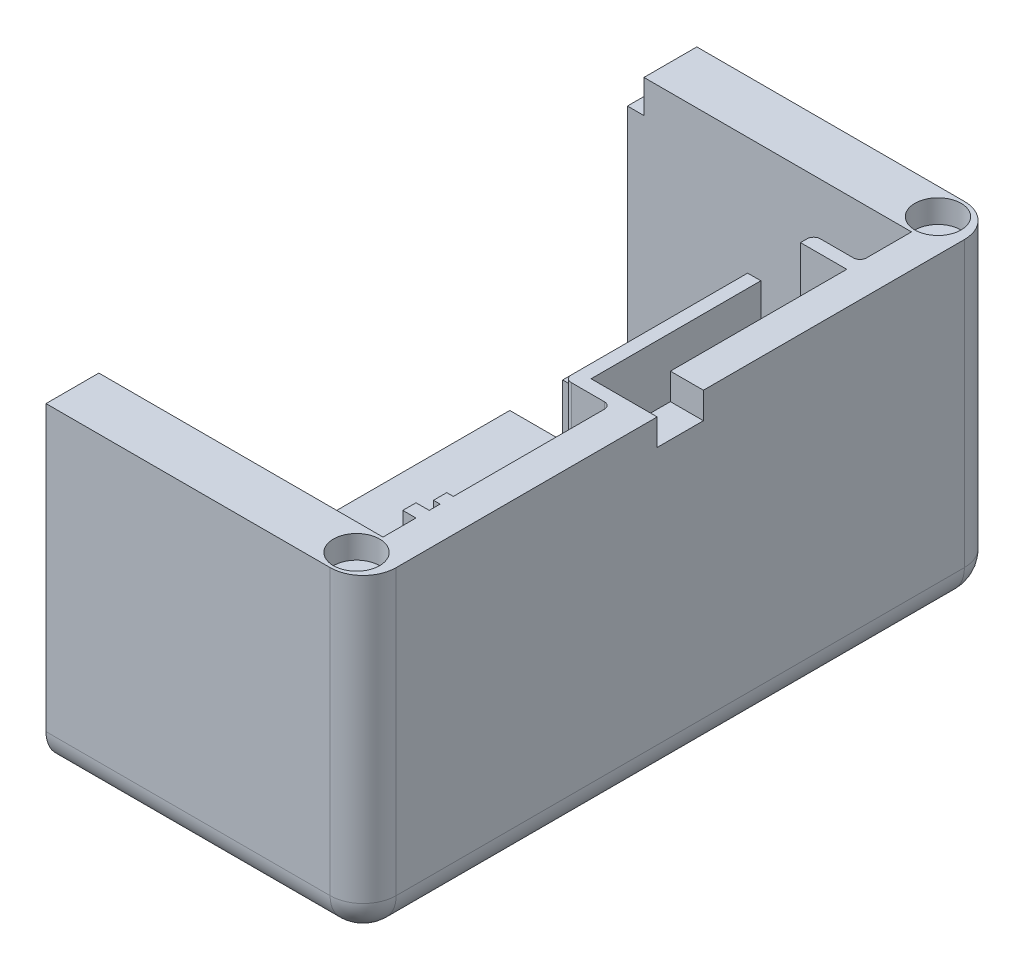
ISO-10303-21;
HEADER;
FILE_DESCRIPTION(('STEP AP214'),'2;1');
FILE_NAME('part.step','',(''),(''),'','','');
FILE_SCHEMA(('AUTOMOTIVE_DESIGN { 1 0 10303 214 1 1 1 1 }'));
ENDSEC;
DATA;
#1=APPLICATION_CONTEXT('core data for automotive mechanical design processes');
#2=APPLICATION_PROTOCOL_DEFINITION('international standard','automotive_design',2000,#1);
#3=PRODUCT_CONTEXT('',#1,'mechanical');
#4=PRODUCT('Part','Part','',(#3));
#5=PRODUCT_RELATED_PRODUCT_CATEGORY('part','',(#4));
#6=PRODUCT_DEFINITION_FORMATION('','',#4);
#7=PRODUCT_DEFINITION_CONTEXT('part definition',#1,'design');
#8=PRODUCT_DEFINITION('design','',#6,#7);
#9=PRODUCT_DEFINITION_SHAPE('','',#8);
#10=(LENGTH_UNIT() NAMED_UNIT(*) SI_UNIT(.MILLI.,.METRE.));
#11=(NAMED_UNIT(*) PLANE_ANGLE_UNIT() SI_UNIT($,.RADIAN.));
#12=(NAMED_UNIT(*) SI_UNIT($,.STERADIAN.) SOLID_ANGLE_UNIT());
#13=UNCERTAINTY_MEASURE_WITH_UNIT(LENGTH_MEASURE(1.E-05),#10,'distance_accuracy_value','');
#14=(GEOMETRIC_REPRESENTATION_CONTEXT(3) GLOBAL_UNCERTAINTY_ASSIGNED_CONTEXT((#13)) GLOBAL_UNIT_ASSIGNED_CONTEXT((#10,
#11,#12)) REPRESENTATION_CONTEXT('',''));
#15=CARTESIAN_POINT('',(0.,0.,0.));
#16=DIRECTION('',(0.,0.,1.));
#17=DIRECTION('',(1.,0.,0.));
#18=AXIS2_PLACEMENT_3D('',#15,#16,#17);
#19=CARTESIAN_POINT('',(-22.5530221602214,-8.75,8.));
#20=DIRECTION('',(1.,0.,0.));
#21=DIRECTION('',(0.,0.,-1.));
#22=AXIS2_PLACEMENT_3D('',#19,#20,#21);
#23=PLANE('',#22);
#24=CARTESIAN_POINT('',(-22.5530221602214,-3.75000000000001,4.));
#25=DIRECTION('',(-1.,0.,0.));
#26=DIRECTION('',(0.,0.,-1.));
#27=AXIS2_PLACEMENT_3D('',#24,#25,#26);
#28=CIRCLE('',#27,3.5);
#29=CARTESIAN_POINT('',(-22.5530221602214,-3.75000000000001,0.500000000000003));
#30=VERTEX_POINT('',#29);
#31=EDGE_CURVE('E512',#30,#30,#28,.T.);
#32=ORIENTED_EDGE('',*,*,#31,.F.);
#33=EDGE_LOOP('',(#32));
#34=FACE_BOUND('',#33,.T.);
#35=DIRECTION('',(0.,0.,-1.));
#36=VECTOR('',#35,1.);
#37=CARTESIAN_POINT('',(-22.5530221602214,3.24999999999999,0.));
#38=LINE('',#37,#36);
#39=CARTESIAN_POINT('',(-22.5530221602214,3.24999999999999,17.8062937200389));
#40=VERTEX_POINT('',#39);
#41=CARTESIAN_POINT('',(-22.5530221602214,3.24999999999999,16.8062937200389));
#42=VERTEX_POINT('',#41);
#43=EDGE_CURVE('E558',#40,#42,#38,.T.);
#44=ORIENTED_EDGE('',*,*,#43,.T.);
#45=CARTESIAN_POINT('',(-22.5530221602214,2.25,16.8062937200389));
#46=DIRECTION('',(1.,0.,0.));
#47=DIRECTION('',(0.,0.,-1.));
#48=AXIS2_PLACEMENT_3D('',#45,#46,#47);
#49=CIRCLE('',#48,1.);
#50=CARTESIAN_POINT('',(-22.5530221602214,2.25,15.8062937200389));
#51=VERTEX_POINT('',#50);
#52=EDGE_CURVE('E816',#42,#51,#49,.F.);
#53=ORIENTED_EDGE('',*,*,#52,.T.);
#54=DIRECTION('',(0.,-1.,0.));
#55=VECTOR('',#54,1.);
#56=CARTESIAN_POINT('',(-22.5530221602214,3.24999999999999,15.8062937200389));
#57=LINE('',#56,#55);
#58=CARTESIAN_POINT('',(-22.5530221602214,-2.75,15.8062937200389));
#59=VERTEX_POINT('',#58);
#60=EDGE_CURVE('E557',#51,#59,#57,.T.);
#61=ORIENTED_EDGE('',*,*,#60,.T.);
#62=CARTESIAN_POINT('',(-22.5530221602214,-2.75,14.8062937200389));
#63=DIRECTION('',(1.,0.,0.));
#64=DIRECTION('',(0.,0.,-1.));
#65=AXIS2_PLACEMENT_3D('',#62,#63,#64);
#66=CIRCLE('',#65,1.);
#67=CARTESIAN_POINT('',(-22.5530221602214,-3.75,14.8062937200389));
#68=VERTEX_POINT('',#67);
#69=EDGE_CURVE('E826',#59,#68,#66,.T.);
#70=ORIENTED_EDGE('',*,*,#69,.T.);
#71=DIRECTION('',(0.,0.,-1.));
#72=VECTOR('',#71,1.);
#73=CARTESIAN_POINT('',(-22.5530221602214,-3.75,88.));
#74=LINE('',#73,#72);
#75=CARTESIAN_POINT('',(-22.5530221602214,-3.75,8.));
#76=VERTEX_POINT('',#75);
#77=EDGE_CURVE('E685',#68,#76,#74,.T.);
#78=ORIENTED_EDGE('',*,*,#77,.T.);
#79=DIRECTION('',(0.,-1.,0.));
#80=VECTOR('',#79,1.);
#81=CARTESIAN_POINT('',(-22.5530221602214,-8.75,8.));
#82=LINE('',#81,#80);
#83=CARTESIAN_POINT('',(-22.5530221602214,34.25,8.));
#84=VERTEX_POINT('',#83);
#85=EDGE_CURVE('E704',#84,#76,#82,.T.);
#86=ORIENTED_EDGE('',*,*,#85,.F.);
#87=DIRECTION('',(0.,0.,-1.));
#88=VECTOR('',#87,1.);
#89=CARTESIAN_POINT('',(-22.5530221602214,34.25,10.));
#90=LINE('',#89,#88);
#91=CARTESIAN_POINT('',(-22.5530221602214,34.25,0.));
#92=VERTEX_POINT('',#91);
#93=EDGE_CURVE('E498',#84,#92,#90,.T.);
#94=ORIENTED_EDGE('',*,*,#93,.T.);
#95=DIRECTION('',(0.,-1.,0.));
#96=VECTOR('',#95,1.);
#97=CARTESIAN_POINT('',(-22.5530221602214,-8.75,0.));
#98=LINE('',#97,#96);
#99=CARTESIAN_POINT('',(-22.5530221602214,-3.75,0.));
#100=VERTEX_POINT('',#99);
#101=EDGE_CURVE('E701',#92,#100,#98,.T.);
#102=ORIENTED_EDGE('',*,*,#101,.T.);
#103=CARTESIAN_POINT('',(-22.5530221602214,-3.75,5.));
#104=DIRECTION('',(1.,0.,0.));
#105=DIRECTION('',(0.,0.,-1.));
#106=AXIS2_PLACEMENT_3D('',#103,#104,#105);
#107=CIRCLE('',#106,5.);
#108=CARTESIAN_POINT('',(-22.5530221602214,-8.75,5.));
#109=VERTEX_POINT('',#108);
#110=EDGE_CURVE('E732',#100,#109,#107,.F.);
#111=ORIENTED_EDGE('',*,*,#110,.T.);
#112=DIRECTION('',(0.,0.,-1.));
#113=VECTOR('',#112,1.);
#114=CARTESIAN_POINT('',(-22.5530221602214,-8.75,8.));
#115=LINE('',#114,#113);
#116=CARTESIAN_POINT('',(-22.5530221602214,-8.75000000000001,44.5));
#117=VERTEX_POINT('',#116);
#118=EDGE_CURVE('E717',#117,#109,#115,.T.);
#119=ORIENTED_EDGE('',*,*,#118,.F.);
#120=DIRECTION('',(0.,-1.,0.));
#121=VECTOR('',#120,1.);
#122=CARTESIAN_POINT('',(-22.5530221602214,1.24999999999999,44.5));
#123=LINE('',#122,#121);
#124=CARTESIAN_POINT('',(-22.5530221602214,-3.75,44.5));
#125=VERTEX_POINT('',#124);
#126=EDGE_CURVE('E588',#125,#117,#123,.T.);
#127=ORIENTED_EDGE('',*,*,#126,.F.);
#128=CARTESIAN_POINT('',(-22.5530221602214,-3.75000000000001,17.8062937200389));
#129=VERTEX_POINT('',#128);
#130=EDGE_CURVE('E694',#125,#129,#74,.T.);
#131=ORIENTED_EDGE('',*,*,#130,.T.);
#132=DIRECTION('',(0.,-1.,0.));
#133=VECTOR('',#132,1.);
#134=CARTESIAN_POINT('',(-22.5530221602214,3.24999999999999,17.8062937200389));
#135=LINE('',#134,#133);
#136=EDGE_CURVE('E576',#40,#129,#135,.T.);
#137=ORIENTED_EDGE('',*,*,#136,.F.);
#138=EDGE_LOOP('',(#44,#53,#61,#70,#78,#86,#94,#102,#111,#119,#127,#131,#137));
#139=FACE_BOUND('',#138,.T.);
#140=ADVANCED_FACE('F37',(#34,#139),#23,.F.);
#141=CARTESIAN_POINT('',(16.6969778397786,3.25000000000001,0.));
#142=DIRECTION('',(0.,1.,0.));
#143=DIRECTION('',(0.,0.,1.));
#144=AXIS2_PLACEMENT_3D('',#141,#142,#143);
#145=PLANE('',#144);
#146=DIRECTION('',(0.,0.,-1.));
#147=VECTOR('',#146,1.);
#148=CARTESIAN_POINT('',(-12.5530221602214,3.25,15.8062937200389));
#149=LINE('',#148,#147);
#150=CARTESIAN_POINT('',(-12.5530221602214,3.25,52.5));
#151=VERTEX_POINT('',#150);
#152=CARTESIAN_POINT('',(-12.5530221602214,3.25,16.8062937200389));
#153=VERTEX_POINT('',#152);
#154=EDGE_CURVE('E812',#151,#153,#149,.T.);
#155=ORIENTED_EDGE('',*,*,#154,.T.);
#156=DIRECTION('',(1.,0.,0.));
#157=VECTOR('',#156,1.);
#158=CARTESIAN_POINT('',(16.6969778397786,3.25000000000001,16.8062937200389));
#159=LINE('',#158,#157);
#160=EDGE_CURVE('E814',#153,#42,#159,.F.);
#161=ORIENTED_EDGE('',*,*,#160,.T.);
#162=ORIENTED_EDGE('',*,*,#43,.F.);
#163=DIRECTION('',(1.,0.,0.));
#164=VECTOR('',#163,1.);
#165=CARTESIAN_POINT('',(16.6969778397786,3.25000000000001,17.8062937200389));
#166=LINE('',#165,#164);
#167=CARTESIAN_POINT('',(-13.5530221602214,3.25,17.8062937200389));
#168=VERTEX_POINT('',#167);
#169=EDGE_CURVE('E538',#40,#168,#166,.T.);
#170=ORIENTED_EDGE('',*,*,#169,.T.);
#171=DIRECTION('',(0.,0.,-1.));
#172=VECTOR('',#171,1.);
#173=CARTESIAN_POINT('',(-13.5530221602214,3.25,0.));
#174=LINE('',#173,#172);
#175=CARTESIAN_POINT('',(-13.5530221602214,3.25,25.8062937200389));
#176=VERTEX_POINT('',#175);
#177=EDGE_CURVE('E535',#176,#168,#174,.T.);
#178=ORIENTED_EDGE('',*,*,#177,.F.);
#179=DIRECTION('',(1.,0.,0.));
#180=VECTOR('',#179,1.);
#181=CARTESIAN_POINT('',(16.6969778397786,3.25000000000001,25.8062937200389));
#182=LINE('',#181,#180);
#183=CARTESIAN_POINT('',(-22.5530221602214,3.24999999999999,25.8062937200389));
#184=VERTEX_POINT('',#183);
#185=EDGE_CURVE('E530',#184,#176,#182,.T.);
#186=ORIENTED_EDGE('',*,*,#185,.F.);
#187=CARTESIAN_POINT('',(-22.5530221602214,3.24999999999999,52.5));
#188=VERTEX_POINT('',#187);
#189=EDGE_CURVE('E555',#188,#184,#38,.T.);
#190=ORIENTED_EDGE('',*,*,#189,.F.);
#191=DIRECTION('',(-1.,0.,0.));
#192=VECTOR('',#191,1.);
#193=CARTESIAN_POINT('',(16.6969778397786,3.25000000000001,52.5));
#194=LINE('',#193,#192);
#195=EDGE_CURVE('E810',#188,#151,#194,.F.);
#196=ORIENTED_EDGE('',*,*,#195,.T.);
#197=EDGE_LOOP('',(#155,#161,#162,#170,#178,#186,#190,#196));
#198=FACE_BOUND('',#197,.T.);
#199=ADVANCED_FACE('F980',(#198),#145,.T.);
#200=CARTESIAN_POINT('',(-22.5530221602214,-3.75,88.));
#201=DIRECTION('',(0.,-1.,0.));
#202=DIRECTION('',(0.,0.,-1.));
#203=AXIS2_PLACEMENT_3D('',#200,#201,#202);
#204=PLANE('',#203);
#205=DIRECTION('',(1.,0.,0.));
#206=VECTOR('',#205,1.);
#207=CARTESIAN_POINT('',(16.6969778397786,-3.74999999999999,17.8062937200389));
#208=LINE('',#207,#206);
#209=CARTESIAN_POINT('',(-13.5530221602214,-3.75,17.8062937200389));
#210=VERTEX_POINT('',#209);
#211=EDGE_CURVE('E554',#129,#210,#208,.T.);
#212=ORIENTED_EDGE('',*,*,#211,.F.);
#213=ORIENTED_EDGE('',*,*,#130,.F.);
#214=DIRECTION('',(-1.,0.,0.));
#215=VECTOR('',#214,1.);
#216=CARTESIAN_POINT('',(-22.5530221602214,-3.75,44.5));
#217=LINE('',#216,#215);
#218=CARTESIAN_POINT('',(-18.5530221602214,-3.75,44.5));
#219=VERTEX_POINT('',#218);
#220=EDGE_CURVE('E778',#219,#125,#217,.T.);
#221=ORIENTED_EDGE('',*,*,#220,.F.);
#222=DIRECTION('',(0.,0.,-1.));
#223=VECTOR('',#222,1.);
#224=CARTESIAN_POINT('',(-18.5530221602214,-3.75,88.));
#225=LINE('',#224,#223);
#226=CARTESIAN_POINT('',(-18.5530221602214,-3.75,51.5));
#227=VERTEX_POINT('',#226);
#228=EDGE_CURVE('E776',#227,#219,#225,.T.);
#229=ORIENTED_EDGE('',*,*,#228,.F.);
#230=DIRECTION('',(1.,0.,0.));
#231=VECTOR('',#230,1.);
#232=CARTESIAN_POINT('',(16.6969778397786,-3.74999999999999,51.5));
#233=LINE('',#232,#231);
#234=CARTESIAN_POINT('',(-13.5530221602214,-3.75,51.5));
#235=VERTEX_POINT('',#234);
#236=EDGE_CURVE('E564',#227,#235,#233,.T.);
#237=ORIENTED_EDGE('',*,*,#236,.T.);
#238=DIRECTION('',(0.,0.,-1.));
#239=VECTOR('',#238,1.);
#240=CARTESIAN_POINT('',(-13.5530221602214,-3.75,0.));
#241=LINE('',#240,#239);
#242=EDGE_CURVE('E561',#235,#210,#241,.T.);
#243=ORIENTED_EDGE('',*,*,#242,.T.);
#244=EDGE_LOOP('',(#212,#213,#221,#229,#237,#243));
#245=FACE_BOUND('',#244,.T.);
#246=ADVANCED_FACE('F987',(#245),#204,.F.);
#247=CARTESIAN_POINT('',(-22.5530221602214,-3.75000000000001,92.));
#248=DIRECTION('',(1.,0.,0.));
#249=DIRECTION('',(0.,0.,1.));
#250=AXIS2_PLACEMENT_3D('',#247,#248,#249);
#251=CIRCLE('',#250,3.5);
#252=CARTESIAN_POINT('',(-22.5530221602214,-3.75000000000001,95.5));
#253=VERTEX_POINT('',#252);
#254=EDGE_CURVE('E518',#253,#253,#251,.T.);
#255=ORIENTED_EDGE('',*,*,#254,.T.);
#256=EDGE_LOOP('',(#255));
#257=FACE_BOUND('',#256,.T.);
#258=DIRECTION('',(0.,-1.,0.));
#259=VECTOR('',#258,1.);
#260=CARTESIAN_POINT('',(-22.5530221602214,3.24999999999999,53.5));
#261=LINE('',#260,#259);
#262=CARTESIAN_POINT('',(-22.5530221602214,2.25,53.5));
#263=VERTEX_POINT('',#262);
#264=CARTESIAN_POINT('',(-22.5530221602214,-2.75,53.5));
#265=VERTEX_POINT('',#264);
#266=EDGE_CURVE('E569',#263,#265,#261,.T.);
#267=ORIENTED_EDGE('',*,*,#266,.F.);
#268=CARTESIAN_POINT('',(-22.5530221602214,2.25,52.5));
#269=DIRECTION('',(1.,0.,0.));
#270=DIRECTION('',(0.,0.,-1.));
#271=AXIS2_PLACEMENT_3D('',#268,#269,#270);
#272=CIRCLE('',#271,1.);
#273=EDGE_CURVE('E824',#263,#188,#272,.F.);
#274=ORIENTED_EDGE('',*,*,#273,.T.);
#275=ORIENTED_EDGE('',*,*,#189,.T.);
#276=DIRECTION('',(0.,1.,0.));
#277=VECTOR('',#276,1.);
#278=CARTESIAN_POINT('',(-22.5530221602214,-1.75000000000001,25.8062937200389));
#279=LINE('',#278,#277);
#280=CARTESIAN_POINT('',(-22.5530221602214,1.24999999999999,25.8062937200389));
#281=VERTEX_POINT('',#280);
#282=EDGE_CURVE('E541',#281,#184,#279,.T.);
#283=ORIENTED_EDGE('',*,*,#282,.F.);
#284=DIRECTION('',(0.,0.,-1.));
#285=VECTOR('',#284,1.);
#286=CARTESIAN_POINT('',(-22.5530221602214,1.24999999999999,51.5));
#287=LINE('',#286,#285);
#288=CARTESIAN_POINT('',(-22.5530221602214,1.24999999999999,51.5));
#289=VERTEX_POINT('',#288);
#290=EDGE_CURVE('E547',#289,#281,#287,.T.);
#291=ORIENTED_EDGE('',*,*,#290,.F.);
#292=DIRECTION('',(0.,-1.,0.));
#293=VECTOR('',#292,1.);
#294=CARTESIAN_POINT('',(-22.5530221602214,1.24999999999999,51.5));
#295=LINE('',#294,#293);
#296=CARTESIAN_POINT('',(-22.5530221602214,-8.75000000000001,51.5));
#297=VERTEX_POINT('',#296);
#298=EDGE_CURVE('E591',#289,#297,#295,.T.);
#299=ORIENTED_EDGE('',*,*,#298,.T.);
#300=CARTESIAN_POINT('',(-22.5530221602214,-8.75,91.));
#301=VERTEX_POINT('',#300);
#302=EDGE_CURVE('E718',#301,#297,#115,.T.);
#303=ORIENTED_EDGE('',*,*,#302,.F.);
#304=CARTESIAN_POINT('',(-22.5530221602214,-3.75,91.));
#305=DIRECTION('',(1.,0.,0.));
#306=DIRECTION('',(0.,0.,-1.));
#307=AXIS2_PLACEMENT_3D('',#304,#305,#306);
#308=CIRCLE('',#307,5.);
#309=CARTESIAN_POINT('',(-22.5530221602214,-3.75,96.));
#310=VERTEX_POINT('',#309);
#311=EDGE_CURVE('E735',#301,#310,#308,.F.);
#312=ORIENTED_EDGE('',*,*,#311,.T.);
#313=DIRECTION('',(0.,-1.,0.));
#314=VECTOR('',#313,1.);
#315=CARTESIAN_POINT('',(-22.5530221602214,-8.75,96.));
#316=LINE('',#315,#314);
#317=CARTESIAN_POINT('',(-22.5530221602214,39.25,96.));
#318=VERTEX_POINT('',#317);
#319=EDGE_CURVE('E663',#318,#310,#316,.T.);
#320=ORIENTED_EDGE('',*,*,#319,.F.);
#321=DIRECTION('',(0.,0.,-1.));
#322=VECTOR('',#321,1.);
#323=CARTESIAN_POINT('',(-22.5530221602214,39.25,96.));
#324=LINE('',#323,#322);
#325=CARTESIAN_POINT('',(-22.5530221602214,39.25,88.));
#326=VERTEX_POINT('',#325);
#327=EDGE_CURVE('E669',#318,#326,#324,.T.);
#328=ORIENTED_EDGE('',*,*,#327,.T.);
#329=DIRECTION('',(0.,-1.,0.));
#330=VECTOR('',#329,1.);
#331=CARTESIAN_POINT('',(-22.5530221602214,-8.75,88.));
#332=LINE('',#331,#330);
#333=CARTESIAN_POINT('',(-22.5530221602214,-3.75,88.));
#334=VERTEX_POINT('',#333);
#335=EDGE_CURVE('E670',#326,#334,#332,.T.);
#336=ORIENTED_EDGE('',*,*,#335,.T.);
#337=CARTESIAN_POINT('',(-22.5530221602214,-3.75,54.5));
#338=VERTEX_POINT('',#337);
#339=EDGE_CURVE('E690',#334,#338,#74,.T.);
#340=ORIENTED_EDGE('',*,*,#339,.T.);
#341=CARTESIAN_POINT('',(-22.5530221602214,-2.75,54.5));
#342=DIRECTION('',(1.,0.,0.));
#343=DIRECTION('',(0.,0.,-1.));
#344=AXIS2_PLACEMENT_3D('',#341,#342,#343);
#345=CIRCLE('',#344,1.);
#346=EDGE_CURVE('E828',#338,#265,#345,.T.);
#347=ORIENTED_EDGE('',*,*,#346,.T.);
#348=EDGE_LOOP('',(#267,#274,#275,#283,#291,#299,#303,#312,#320,#328,#336,#340,#347));
#349=FACE_BOUND('',#348,.T.);
#350=ADVANCED_FACE('F983',(#257,#349),#23,.F.);
#351=CARTESIAN_POINT('',(-22.5530221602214,-8.75,8.));
#352=DIRECTION('',(0.,1.,0.));
#353=DIRECTION('',(0.,0.,1.));
#354=AXIS2_PLACEMENT_3D('',#351,#352,#353);
#355=PLANE('',#354);
#356=DIRECTION('',(-1.,0.,0.));
#357=VECTOR('',#356,1.);
#358=CARTESIAN_POINT('',(-22.5530221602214,-8.75000000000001,44.5));
#359=LINE('',#358,#357);
#360=CARTESIAN_POINT('',(-18.5530221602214,-8.75000000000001,44.5));
#361=VERTEX_POINT('',#360);
#362=EDGE_CURVE('E578',#361,#117,#359,.T.);
#363=ORIENTED_EDGE('',*,*,#362,.T.);
#364=ORIENTED_EDGE('',*,*,#118,.T.);
#365=DIRECTION('',(1.,0.,0.));
#366=VECTOR('',#365,1.);
#367=CARTESIAN_POINT('',(25.4469778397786,-8.75,5.));
#368=LINE('',#367,#366);
#369=CARTESIAN_POINT('',(20.4469778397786,-8.75,5.));
#370=VERTEX_POINT('',#369);
#371=EDGE_CURVE('E728',#109,#370,#368,.T.);
#372=ORIENTED_EDGE('',*,*,#371,.T.);
#373=DIRECTION('',(0.,0.,-1.));
#374=VECTOR('',#373,1.);
#375=CARTESIAN_POINT('',(20.4469778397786,-8.75,8.));
#376=LINE('',#375,#374);
#377=CARTESIAN_POINT('',(20.4469778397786,-8.75,91.));
#378=VERTEX_POINT('',#377);
#379=EDGE_CURVE('E726',#370,#378,#376,.F.);
#380=ORIENTED_EDGE('',*,*,#379,.T.);
#381=DIRECTION('',(1.,0.,0.));
#382=VECTOR('',#381,1.);
#383=CARTESIAN_POINT('',(-22.5530221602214,-8.75,91.));
#384=LINE('',#383,#382);
#385=EDGE_CURVE('E730',#378,#301,#384,.F.);
#386=ORIENTED_EDGE('',*,*,#385,.T.);
#387=ORIENTED_EDGE('',*,*,#302,.T.);
#388=DIRECTION('',(1.,0.,0.));
#389=VECTOR('',#388,1.);
#390=CARTESIAN_POINT('',(-22.5530221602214,-8.75000000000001,51.5));
#391=LINE('',#390,#389);
#392=CARTESIAN_POINT('',(-18.5530221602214,-8.75000000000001,51.5));
#393=VERTEX_POINT('',#392);
#394=EDGE_CURVE('E584',#297,#393,#391,.T.);
#395=ORIENTED_EDGE('',*,*,#394,.T.);
#396=DIRECTION('',(0.,0.,-1.));
#397=VECTOR('',#396,1.);
#398=CARTESIAN_POINT('',(-18.5530221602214,-8.75000000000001,44.5));
#399=LINE('',#398,#397);
#400=EDGE_CURVE('E581',#393,#361,#399,.T.);
#401=ORIENTED_EDGE('',*,*,#400,.T.);
#402=EDGE_LOOP('',(#363,#364,#372,#380,#386,#387,#395,#401));
#403=FACE_BOUND('',#402,.T.);
#404=ADVANCED_FACE('F995',(#403),#355,.F.);
#405=ORIENTED_EDGE('',*,*,#77,.F.);
#406=DIRECTION('',(1.,0.,0.));
#407=VECTOR('',#406,1.);
#408=CARTESIAN_POINT('',(-22.5530221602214,-3.75,14.8062937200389));
#409=LINE('',#408,#407);
#410=CARTESIAN_POINT('',(-12.5530221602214,-3.75,14.8062937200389));
#411=VERTEX_POINT('',#410);
#412=EDGE_CURVE('E792',#68,#411,#409,.T.);
#413=ORIENTED_EDGE('',*,*,#412,.T.);
#414=CARTESIAN_POINT('',(-12.5530221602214,-3.75,16.8062937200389));
#415=DIRECTION('',(0.,-1.,0.));
#416=DIRECTION('',(0.,0.,-1.));
#417=AXIS2_PLACEMENT_3D('',#414,#415,#416);
#418=CIRCLE('',#417,2.);
#419=CARTESIAN_POINT('',(-10.5530221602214,-3.75,16.8062937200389));
#420=VERTEX_POINT('',#419);
#421=EDGE_CURVE('E789',#420,#411,#418,.F.);
#422=ORIENTED_EDGE('',*,*,#421,.F.);
#423=DIRECTION('',(0.,0.,-1.));
#424=VECTOR('',#423,1.);
#425=CARTESIAN_POINT('',(-10.5530221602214,-3.75,53.5));
#426=LINE('',#425,#424);
#427=CARTESIAN_POINT('',(-10.5530221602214,-3.75,52.5));
#428=VERTEX_POINT('',#427);
#429=EDGE_CURVE('E787',#420,#428,#426,.F.);
#430=ORIENTED_EDGE('',*,*,#429,.T.);
#431=CARTESIAN_POINT('',(-12.5530221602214,-3.75,52.5));
#432=DIRECTION('',(0.,-1.,0.));
#433=DIRECTION('',(0.,0.,-1.));
#434=AXIS2_PLACEMENT_3D('',#431,#432,#433);
#435=CIRCLE('',#434,2.);
#436=CARTESIAN_POINT('',(-12.5530221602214,-3.75,54.5));
#437=VERTEX_POINT('',#436);
#438=EDGE_CURVE('E784',#437,#428,#435,.F.);
#439=ORIENTED_EDGE('',*,*,#438,.F.);
#440=DIRECTION('',(-1.,0.,0.));
#441=VECTOR('',#440,1.);
#442=CARTESIAN_POINT('',(-22.5530221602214,-3.75,54.5));
#443=LINE('',#442,#441);
#444=EDGE_CURVE('E782',#437,#338,#443,.T.);
#445=ORIENTED_EDGE('',*,*,#444,.T.);
#446=ORIENTED_EDGE('',*,*,#339,.F.);
#447=DIRECTION('',(-1.,0.,0.));
#448=VECTOR('',#447,1.);
#449=CARTESIAN_POINT('',(-22.5530221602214,-3.75,88.));
#450=LINE('',#449,#448);
#451=CARTESIAN_POINT('',(20.4469778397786,-3.75,88.));
#452=VERTEX_POINT('',#451);
#453=EDGE_CURVE('E681',#452,#334,#450,.T.);
#454=ORIENTED_EDGE('',*,*,#453,.F.);
#455=DIRECTION('',(0.,0.,-1.));
#456=VECTOR('',#455,1.);
#457=CARTESIAN_POINT('',(20.4469778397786,-3.75,88.));
#458=LINE('',#457,#456);
#459=CARTESIAN_POINT('',(20.4469778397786,-3.75,8.));
#460=VERTEX_POINT('',#459);
#461=EDGE_CURVE('E693',#452,#460,#458,.T.);
#462=ORIENTED_EDGE('',*,*,#461,.T.);
#463=DIRECTION('',(-1.,0.,0.));
#464=VECTOR('',#463,1.);
#465=CARTESIAN_POINT('',(-22.5530221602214,-3.75,8.));
#466=LINE('',#465,#464);
#467=EDGE_CURVE('E682',#460,#76,#466,.T.);
#468=ORIENTED_EDGE('',*,*,#467,.T.);
#469=EDGE_LOOP('',(#405,#413,#422,#430,#439,#445,#446,#454,#462,#468));
#470=FACE_BOUND('',#469,.T.);
#471=ADVANCED_FACE('F1001',(#470),#204,.F.);
#472=CARTESIAN_POINT('',(-22.5530221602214,39.25,8.));
#473=DIRECTION('',(0.,-1.,0.));
#474=DIRECTION('',(0.,0.,-1.));
#475=AXIS2_PLACEMENT_3D('',#472,#473,#474);
#476=PLANE('',#475);
#477=DIRECTION('',(0.,0.,-1.));
#478=VECTOR('',#477,1.);
#479=CARTESIAN_POINT('',(13.4469778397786,39.25,0.));
#480=LINE('',#479,#478);
#481=CARTESIAN_POINT('',(13.4469778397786,39.25,52.5));
#482=VERTEX_POINT('',#481);
#483=CARTESIAN_POINT('',(13.4469778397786,39.25,25.8062937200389));
#484=VERTEX_POINT('',#483);
#485=EDGE_CURVE('E618',#482,#484,#480,.T.);
#486=ORIENTED_EDGE('',*,*,#485,.F.);
#487=CARTESIAN_POINT('',(14.4469778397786,39.25,52.5));
#488=DIRECTION('',(0.,-1.,0.));
#489=DIRECTION('',(0.,0.,-1.));
#490=AXIS2_PLACEMENT_3D('',#487,#488,#489);
#491=CIRCLE('',#490,1.);
#492=CARTESIAN_POINT('',(14.4469778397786,39.25,53.5));
#493=VERTEX_POINT('',#492);
#494=EDGE_CURVE('E888',#482,#493,#491,.F.);
#495=ORIENTED_EDGE('',*,*,#494,.T.);
#496=DIRECTION('',(1.,0.,0.));
#497=VECTOR('',#496,1.);
#498=CARTESIAN_POINT('',(13.4469778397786,39.25,53.5));
#499=LINE('',#498,#497);
#500=CARTESIAN_POINT('',(19.4469778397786,39.25,53.5));
#501=VERTEX_POINT('',#500);
#502=EDGE_CURVE('E635',#493,#501,#499,.T.);
#503=ORIENTED_EDGE('',*,*,#502,.T.);
#504=CARTESIAN_POINT('',(19.4469778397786,39.25,54.5));
#505=DIRECTION('',(0.,-1.,0.));
#506=DIRECTION('',(0.,0.,-1.));
#507=AXIS2_PLACEMENT_3D('',#504,#505,#506);
#508=CIRCLE('',#507,1.);
#509=CARTESIAN_POINT('',(20.4469778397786,39.25,54.5));
#510=VERTEX_POINT('',#509);
#511=EDGE_CURVE('E11',#501,#510,#508,.T.);
#512=ORIENTED_EDGE('',*,*,#511,.T.);
#513=DIRECTION('',(0.,0.,-1.));
#514=VECTOR('',#513,1.);
#515=CARTESIAN_POINT('',(20.4469778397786,39.25,88.));
#516=LINE('',#515,#514);
#517=CARTESIAN_POINT('',(20.4469778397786,39.2500000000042,77.3499999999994));
#518=VERTEX_POINT('',#517);
#519=EDGE_CURVE('E961',#518,#510,#516,.T.);
#520=ORIENTED_EDGE('',*,*,#519,.F.);
#521=DIRECTION('',(-1.,0.,0.));
#522=VECTOR('',#521,1.);
#523=CARTESIAN_POINT('',(25.4469778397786,39.2500000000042,77.3499999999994));
#524=LINE('',#523,#522);
#525=CARTESIAN_POINT('',(19.4469778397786,39.2500000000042,77.3499999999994));
#526=VERTEX_POINT('',#525);
#527=EDGE_CURVE('E429',#518,#526,#524,.T.);
#528=ORIENTED_EDGE('',*,*,#527,.T.);
#529=DIRECTION('',(0.,0.,-1.));
#530=VECTOR('',#529,1.);
#531=CARTESIAN_POINT('',(19.4469778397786,39.2500000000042,79.3499999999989));
#532=LINE('',#531,#530);
#533=CARTESIAN_POINT('',(19.4469778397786,39.2500000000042,79.3499999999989));
#534=VERTEX_POINT('',#533);
#535=EDGE_CURVE('E433',#534,#526,#532,.T.);
#536=ORIENTED_EDGE('',*,*,#535,.F.);
#537=DIRECTION('',(-1.,0.,0.));
#538=VECTOR('',#537,1.);
#539=CARTESIAN_POINT('',(25.4469778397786,39.2500000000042,79.3499999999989));
#540=LINE('',#539,#538);
#541=CARTESIAN_POINT('',(20.4469778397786,39.2500000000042,79.3499999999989));
#542=VERTEX_POINT('',#541);
#543=EDGE_CURVE('E418',#542,#534,#540,.T.);
#544=ORIENTED_EDGE('',*,*,#543,.F.);
#545=CARTESIAN_POINT('',(20.4469778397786,39.2500000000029,80.9999999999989));
#546=VERTEX_POINT('',#545);
#547=EDGE_CURVE('E702',#546,#542,#516,.T.);
#548=ORIENTED_EDGE('',*,*,#547,.F.);
#549=DIRECTION('',(-1.,0.,0.));
#550=VECTOR('',#549,1.);
#551=CARTESIAN_POINT('',(25.4469778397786,39.2500000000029,80.9999999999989));
#552=LINE('',#551,#550);
#553=CARTESIAN_POINT('',(18.4469778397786,39.2500000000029,80.9999999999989));
#554=VERTEX_POINT('',#553);
#555=EDGE_CURVE('E476',#546,#554,#552,.T.);
#556=ORIENTED_EDGE('',*,*,#555,.T.);
#557=DIRECTION('',(0.,0.,-1.));
#558=VECTOR('',#557,1.);
#559=CARTESIAN_POINT('',(18.4469778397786,39.2500000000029,82.9999999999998));
#560=LINE('',#559,#558);
#561=CARTESIAN_POINT('',(18.4469778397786,39.2500000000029,82.9999999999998));
#562=VERTEX_POINT('',#561);
#563=EDGE_CURVE('E462',#562,#554,#560,.T.);
#564=ORIENTED_EDGE('',*,*,#563,.F.);
#565=DIRECTION('',(-1.,0.,0.));
#566=VECTOR('',#565,1.);
#567=CARTESIAN_POINT('',(25.4469778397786,39.2500000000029,82.9999999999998));
#568=LINE('',#567,#566);
#569=CARTESIAN_POINT('',(20.4469778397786,39.2500000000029,82.9999999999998));
#570=VERTEX_POINT('',#569);
#571=EDGE_CURVE('E471',#570,#562,#568,.T.);
#572=ORIENTED_EDGE('',*,*,#571,.F.);
#573=CARTESIAN_POINT('',(20.4469778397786,39.25,88.));
#574=VERTEX_POINT('',#573);
#575=EDGE_CURVE('E698',#574,#570,#516,.T.);
#576=ORIENTED_EDGE('',*,*,#575,.F.);
#577=DIRECTION('',(-1.,0.,0.));
#578=VECTOR('',#577,1.);
#579=CARTESIAN_POINT('',(-22.5530221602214,39.25,88.));
#580=LINE('',#579,#578);
#581=EDGE_CURVE('E667',#574,#326,#580,.T.);
#582=ORIENTED_EDGE('',*,*,#581,.T.);
#583=ORIENTED_EDGE('',*,*,#327,.F.);
#584=DIRECTION('',(-1.,0.,0.));
#585=VECTOR('',#584,1.);
#586=CARTESIAN_POINT('',(-22.5530221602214,39.25,96.));
#587=LINE('',#586,#585);
#588=CARTESIAN_POINT('',(20.4469778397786,39.25,96.));
#589=VERTEX_POINT('',#588);
#590=EDGE_CURVE('E666',#589,#318,#587,.T.);
#591=ORIENTED_EDGE('',*,*,#590,.F.);
#592=CARTESIAN_POINT('',(20.4469778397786,39.25,91.));
#593=DIRECTION('',(0.,-1.,0.));
#594=DIRECTION('',(0.,0.,-1.));
#595=AXIS2_PLACEMENT_3D('',#592,#593,#594);
#596=CIRCLE('',#595,5.);
#597=CARTESIAN_POINT('',(25.4469778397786,39.25,91.));
#598=VERTEX_POINT('',#597);
#599=EDGE_CURVE('E739',#589,#598,#596,.F.);
#600=ORIENTED_EDGE('',*,*,#599,.T.);
#601=DIRECTION('',(0.,0.,-1.));
#602=VECTOR('',#601,1.);
#603=CARTESIAN_POINT('',(25.4469778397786,39.25,8.));
#604=LINE('',#603,#602);
#605=CARTESIAN_POINT('',(25.4469778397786,39.25,51.5));
#606=VERTEX_POINT('',#605);
#607=EDGE_CURVE('E715',#598,#606,#604,.T.);
#608=ORIENTED_EDGE('',*,*,#607,.T.);
#609=DIRECTION('',(1.,0.,0.));
#610=VECTOR('',#609,1.);
#611=CARTESIAN_POINT('',(15.4469778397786,39.25,51.5));
#612=LINE('',#611,#610);
#613=CARTESIAN_POINT('',(15.4469778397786,39.25,51.5));
#614=VERTEX_POINT('',#613);
#615=EDGE_CURVE('E658',#614,#606,#612,.T.);
#616=ORIENTED_EDGE('',*,*,#615,.F.);
#617=DIRECTION('',(0.,0.,-1.));
#618=VECTOR('',#617,1.);
#619=CARTESIAN_POINT('',(15.4469778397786,39.25,51.5));
#620=LINE('',#619,#618);
#621=CARTESIAN_POINT('',(15.4469778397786,39.25,25.8062937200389));
#622=VERTEX_POINT('',#621);
#623=EDGE_CURVE('E610',#614,#622,#620,.T.);
#624=ORIENTED_EDGE('',*,*,#623,.T.);
#625=DIRECTION('',(-1.,0.,0.));
#626=VECTOR('',#625,1.);
#627=CARTESIAN_POINT('',(18.4469778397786,39.25,25.8062937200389));
#628=LINE('',#627,#626);
#629=EDGE_CURVE('E605',#622,#484,#628,.T.);
#630=ORIENTED_EDGE('',*,*,#629,.T.);
#631=EDGE_LOOP('',(#486,#495,#503,#512,#520,#528,#536,#544,#548,#556,#564,#572,#576,#582,#583,
#591,#600,#608,#616,#624,#630));
#632=FACE_BOUND('',#631,.T.);
#633=CARTESIAN_POINT('',(20.4469778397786,39.25,92.));
#634=DIRECTION('',(0.,1.,0.));
#635=DIRECTION('',(0.,0.,1.));
#636=AXIS2_PLACEMENT_3D('',#633,#634,#635);
#637=CIRCLE('',#636,3.5);
#638=CARTESIAN_POINT('',(20.4469778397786,39.25,95.5));
#639=VERTEX_POINT('',#638);
#640=EDGE_CURVE('E524',#639,#639,#637,.T.);
#641=ORIENTED_EDGE('',*,*,#640,.F.);
#642=EDGE_LOOP('',(#641));
#643=FACE_BOUND('',#642,.T.);
#644=ADVANCED_FACE('F435',(#632,#643),#476,.F.);
#645=CARTESIAN_POINT('',(13.4469778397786,0.,0.));
#646=DIRECTION('',(-1.,0.,0.));
#647=DIRECTION('',(0.,0.,1.));
#648=AXIS2_PLACEMENT_3D('',#645,#646,#647);
#649=PLANE('',#648);
#650=CARTESIAN_POINT('',(13.4469778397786,39.25,17.8062937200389));
#651=VERTEX_POINT('',#650);
#652=CARTESIAN_POINT('',(13.4469778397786,39.25,16.8062937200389));
#653=VERTEX_POINT('',#652);
#654=EDGE_CURVE('E621',#651,#653,#480,.T.);
#655=ORIENTED_EDGE('',*,*,#654,.T.);
#656=DIRECTION('',(0.,-1.,0.));
#657=VECTOR('',#656,1.);
#658=CARTESIAN_POINT('',(13.4469778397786,28.25,16.8062937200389));
#659=LINE('',#658,#657);
#660=CARTESIAN_POINT('',(13.4469778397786,29.25,16.8062937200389));
#661=VERTEX_POINT('',#660);
#662=EDGE_CURVE('E878',#653,#661,#659,.T.);
#663=ORIENTED_EDGE('',*,*,#662,.T.);
#664=DIRECTION('',(0.,0.,-1.));
#665=VECTOR('',#664,1.);
#666=CARTESIAN_POINT('',(13.4469778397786,29.25,0.));
#667=LINE('',#666,#665);
#668=CARTESIAN_POINT('',(13.4469778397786,29.25,52.5));
#669=VERTEX_POINT('',#668);
#670=EDGE_CURVE('E876',#661,#669,#667,.F.);
#671=ORIENTED_EDGE('',*,*,#670,.T.);
#672=DIRECTION('',(0.,1.,0.));
#673=VECTOR('',#672,1.);
#674=CARTESIAN_POINT('',(13.4469778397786,39.25,52.5));
#675=LINE('',#674,#673);
#676=EDGE_CURVE('E874',#669,#482,#675,.T.);
#677=ORIENTED_EDGE('',*,*,#676,.T.);
#678=ORIENTED_EDGE('',*,*,#485,.T.);
#679=DIRECTION('',(0.,-1.,0.));
#680=VECTOR('',#679,1.);
#681=CARTESIAN_POINT('',(13.4469778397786,0.,25.8062937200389));
#682=LINE('',#681,#680);
#683=CARTESIAN_POINT('',(13.4469778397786,30.25,25.8062937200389));
#684=VERTEX_POINT('',#683);
#685=EDGE_CURVE('E601',#484,#684,#682,.T.);
#686=ORIENTED_EDGE('',*,*,#685,.T.);
#687=DIRECTION('',(0.,0.,-1.));
#688=VECTOR('',#687,1.);
#689=CARTESIAN_POINT('',(13.4469778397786,30.25,0.));
#690=LINE('',#689,#688);
#691=CARTESIAN_POINT('',(13.4469778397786,30.25,17.8062937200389));
#692=VERTEX_POINT('',#691);
#693=EDGE_CURVE('E598',#684,#692,#690,.T.);
#694=ORIENTED_EDGE('',*,*,#693,.T.);
#695=DIRECTION('',(0.,-1.,0.));
#696=VECTOR('',#695,1.);
#697=CARTESIAN_POINT('',(13.4469778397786,0.,17.8062937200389));
#698=LINE('',#697,#696);
#699=EDGE_CURVE('E590',#651,#692,#698,.T.);
#700=ORIENTED_EDGE('',*,*,#699,.F.);
#701=EDGE_LOOP('',(#655,#663,#671,#677,#678,#686,#694,#700));
#702=FACE_BOUND('',#701,.T.);
#703=ADVANCED_FACE('F1604',(#702),#649,.T.);
#704=CARTESIAN_POINT('',(15.4469778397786,39.25,51.5));
#705=DIRECTION('',(-1.,0.,0.));
#706=DIRECTION('',(0.,0.,1.));
#707=AXIS2_PLACEMENT_3D('',#704,#705,#706);
#708=PLANE('',#707);
#709=DIRECTION('',(0.,-1.,0.));
#710=VECTOR('',#709,1.);
#711=CARTESIAN_POINT('',(15.4469778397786,39.25,25.8062937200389));
#712=LINE('',#711,#710);
#713=CARTESIAN_POINT('',(15.4469778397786,30.25,25.8062937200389));
#714=VERTEX_POINT('',#713);
#715=EDGE_CURVE('E774',#622,#714,#712,.T.);
#716=ORIENTED_EDGE('',*,*,#715,.F.);
#717=ORIENTED_EDGE('',*,*,#623,.F.);
#718=DIRECTION('',(0.,-1.,0.));
#719=VECTOR('',#718,1.);
#720=CARTESIAN_POINT('',(15.4469778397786,39.25,51.5));
#721=LINE('',#720,#719);
#722=CARTESIAN_POINT('',(15.4469778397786,30.25,51.5));
#723=VERTEX_POINT('',#722);
#724=EDGE_CURVE('E613',#614,#723,#721,.T.);
#725=ORIENTED_EDGE('',*,*,#724,.T.);
#726=DIRECTION('',(0.,0.,-1.));
#727=VECTOR('',#726,1.);
#728=CARTESIAN_POINT('',(15.4469778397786,30.25,51.5));
#729=LINE('',#728,#727);
#730=EDGE_CURVE('E608',#723,#714,#729,.T.);
#731=ORIENTED_EDGE('',*,*,#730,.T.);
#732=EDGE_LOOP('',(#716,#717,#725,#731));
#733=FACE_BOUND('',#732,.T.);
#734=ADVANCED_FACE('F1616',(#733),#708,.F.);
#735=CARTESIAN_POINT('',(15.4469778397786,39.25,51.5));
#736=DIRECTION('',(0.,0.,1.));
#737=DIRECTION('',(1.,0.,0.));
#738=AXIS2_PLACEMENT_3D('',#735,#736,#737);
#739=PLANE('',#738);
#740=ORIENTED_EDGE('',*,*,#724,.F.);
#741=ORIENTED_EDGE('',*,*,#615,.T.);
#742=DIRECTION('',(0.,-1.,0.));
#743=VECTOR('',#742,1.);
#744=CARTESIAN_POINT('',(25.4469778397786,39.25,51.5));
#745=LINE('',#744,#743);
#746=CARTESIAN_POINT('',(25.4469778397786,35.25,51.5));
#747=VERTEX_POINT('',#746);
#748=EDGE_CURVE('E646',#606,#747,#745,.T.);
#749=ORIENTED_EDGE('',*,*,#748,.T.);
#750=DIRECTION('',(1.,0.,0.));
#751=VECTOR('',#750,1.);
#752=CARTESIAN_POINT('',(15.4469778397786,35.25,51.5));
#753=LINE('',#752,#751);
#754=CARTESIAN_POINT('',(20.4469778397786,35.25,51.5));
#755=VERTEX_POINT('',#754);
#756=EDGE_CURVE('E656',#755,#747,#753,.T.);
#757=ORIENTED_EDGE('',*,*,#756,.F.);
#758=DIRECTION('',(0.,-1.,0.));
#759=VECTOR('',#758,1.);
#760=CARTESIAN_POINT('',(20.4469778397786,0.,51.5));
#761=LINE('',#760,#759);
#762=CARTESIAN_POINT('',(20.4469778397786,30.25,51.5));
#763=VERTEX_POINT('',#762);
#764=EDGE_CURVE('E617',#755,#763,#761,.T.);
#765=ORIENTED_EDGE('',*,*,#764,.T.);
#766=DIRECTION('',(1.,0.,0.));
#767=VECTOR('',#766,1.);
#768=CARTESIAN_POINT('',(13.4469778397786,30.25,51.5));
#769=LINE('',#768,#767);
#770=EDGE_CURVE('E633',#723,#763,#769,.T.);
#771=ORIENTED_EDGE('',*,*,#770,.F.);
#772=EDGE_LOOP('',(#740,#741,#749,#757,#765,#771));
#773=FACE_BOUND('',#772,.T.);
#774=ADVANCED_FACE('F1671',(#773),#739,.F.);
#775=CARTESIAN_POINT('',(13.4469778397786,30.25,0.));
#776=DIRECTION('',(0.,-1.,0.));
#777=DIRECTION('',(0.,0.,-1.));
#778=AXIS2_PLACEMENT_3D('',#775,#776,#777);
#779=PLANE('',#778);
#780=DIRECTION('',(1.,0.,0.));
#781=VECTOR('',#780,1.);
#782=CARTESIAN_POINT('',(13.4469778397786,30.25,17.8062937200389));
#783=LINE('',#782,#781);
#784=CARTESIAN_POINT('',(20.4469778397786,30.25,17.8062937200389));
#785=VERTEX_POINT('',#784);
#786=EDGE_CURVE('E631',#692,#785,#783,.T.);
#787=ORIENTED_EDGE('',*,*,#786,.F.);
#788=ORIENTED_EDGE('',*,*,#693,.F.);
#789=DIRECTION('',(-1.,0.,0.));
#790=VECTOR('',#789,1.);
#791=CARTESIAN_POINT('',(18.4469778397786,30.25,25.8062937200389));
#792=LINE('',#791,#790);
#793=EDGE_CURVE('E604',#714,#684,#792,.T.);
#794=ORIENTED_EDGE('',*,*,#793,.F.);
#795=ORIENTED_EDGE('',*,*,#730,.F.);
#796=ORIENTED_EDGE('',*,*,#770,.T.);
#797=DIRECTION('',(0.,0.,-1.));
#798=VECTOR('',#797,1.);
#799=CARTESIAN_POINT('',(20.4469778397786,30.25,0.));
#800=LINE('',#799,#798);
#801=EDGE_CURVE('E624',#763,#785,#800,.T.);
#802=ORIENTED_EDGE('',*,*,#801,.T.);
#803=EDGE_LOOP('',(#787,#788,#794,#795,#796,#802));
#804=FACE_BOUND('',#803,.T.);
#805=ADVANCED_FACE('F1663',(#804),#779,.F.);
#806=CARTESIAN_POINT('',(13.4469778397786,0.,17.8062937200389));
#807=DIRECTION('',(0.,0.,1.));
#808=DIRECTION('',(1.,0.,0.));
#809=AXIS2_PLACEMENT_3D('',#806,#807,#808);
#810=PLANE('',#809);
#811=ORIENTED_EDGE('',*,*,#786,.T.);
#812=DIRECTION('',(0.,-1.,0.));
#813=VECTOR('',#812,1.);
#814=CARTESIAN_POINT('',(20.4469778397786,0.,17.8062937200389));
#815=LINE('',#814,#813);
#816=CARTESIAN_POINT('',(20.4469778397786,39.25,17.8062937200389));
#817=VERTEX_POINT('',#816);
#818=EDGE_CURVE('E627',#817,#785,#815,.T.);
#819=ORIENTED_EDGE('',*,*,#818,.F.);
#820=DIRECTION('',(1.,0.,0.));
#821=VECTOR('',#820,1.);
#822=CARTESIAN_POINT('',(13.4469778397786,39.25,17.8062937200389));
#823=LINE('',#822,#821);
#824=EDGE_CURVE('E620',#651,#817,#823,.T.);
#825=ORIENTED_EDGE('',*,*,#824,.F.);
#826=ORIENTED_EDGE('',*,*,#699,.T.);
#827=EDGE_LOOP('',(#811,#819,#825,#826));
#828=FACE_BOUND('',#827,.T.);
#829=ADVANCED_FACE('F1630',(#828),#810,.T.);
#830=CARTESIAN_POINT('',(20.4469778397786,-3.75,88.));
#831=DIRECTION('',(1.,0.,0.));
#832=DIRECTION('',(0.,0.,-1.));
#833=AXIS2_PLACEMENT_3D('',#830,#831,#832);
#834=PLANE('',#833);
#835=DIRECTION('',(0.,0.,-1.));
#836=VECTOR('',#835,1.);
#837=CARTESIAN_POINT('',(20.4469778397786,27.25,88.));
#838=LINE('',#837,#836);
#839=CARTESIAN_POINT('',(20.4469778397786,27.25,52.5));
#840=VERTEX_POINT('',#839);
#841=CARTESIAN_POINT('',(20.4469778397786,27.25,14.8062937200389));
#842=VERTEX_POINT('',#841);
#843=EDGE_CURVE('E870',#840,#842,#838,.T.);
#844=ORIENTED_EDGE('',*,*,#843,.T.);
#845=DIRECTION('',(0.,-1.,0.));
#846=VECTOR('',#845,1.);
#847=CARTESIAN_POINT('',(20.4469778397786,39.25,14.8062937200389));
#848=LINE('',#847,#846);
#849=CARTESIAN_POINT('',(20.4469778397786,39.25,14.8062937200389));
#850=VERTEX_POINT('',#849);
#851=EDGE_CURVE('E872',#842,#850,#848,.F.);
#852=ORIENTED_EDGE('',*,*,#851,.T.);
#853=CARTESIAN_POINT('',(20.4469778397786,39.25,8.));
#854=VERTEX_POINT('',#853);
#855=EDGE_CURVE('E697',#850,#854,#516,.T.);
#856=ORIENTED_EDGE('',*,*,#855,.T.);
#857=DIRECTION('',(0.,-1.,0.));
#858=VECTOR('',#857,1.);
#859=CARTESIAN_POINT('',(20.4469778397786,-3.75,8.));
#860=LINE('',#859,#858);
#861=EDGE_CURVE('E677',#854,#460,#860,.T.);
#862=ORIENTED_EDGE('',*,*,#861,.T.);
#863=ORIENTED_EDGE('',*,*,#461,.F.);
#864=DIRECTION('',(0.,-1.,0.));
#865=VECTOR('',#864,1.);
#866=CARTESIAN_POINT('',(20.4469778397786,-3.75,88.));
#867=LINE('',#866,#865);
#868=EDGE_CURVE('E678',#574,#452,#867,.T.);
#869=ORIENTED_EDGE('',*,*,#868,.F.);
#870=ORIENTED_EDGE('',*,*,#575,.T.);
#871=DIRECTION('',(0.,1.,0.));
#872=VECTOR('',#871,1.);
#873=CARTESIAN_POINT('',(20.4469778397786,39.2500000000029,82.9999999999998));
#874=LINE('',#873,#872);
#875=CARTESIAN_POINT('',(20.4469778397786,31.1239999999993,82.9999999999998));
#876=VERTEX_POINT('',#875);
#877=EDGE_CURVE('E484',#876,#570,#874,.T.);
#878=ORIENTED_EDGE('',*,*,#877,.F.);
#879=DIRECTION('',(0.,0.,1.));
#880=VECTOR('',#879,1.);
#881=CARTESIAN_POINT('',(20.4469778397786,31.1239999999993,82.9999999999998));
#882=LINE('',#881,#880);
#883=CARTESIAN_POINT('',(20.4469778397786,31.1239999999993,80.9999999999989));
#884=VERTEX_POINT('',#883);
#885=EDGE_CURVE('E488',#884,#876,#882,.T.);
#886=ORIENTED_EDGE('',*,*,#885,.F.);
#887=DIRECTION('',(0.,-1.,0.));
#888=VECTOR('',#887,1.);
#889=CARTESIAN_POINT('',(20.4469778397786,39.2500000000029,80.9999999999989));
#890=LINE('',#889,#888);
#891=EDGE_CURVE('E486',#546,#884,#890,.T.);
#892=ORIENTED_EDGE('',*,*,#891,.F.);
#893=ORIENTED_EDGE('',*,*,#547,.T.);
#894=DIRECTION('',(0.,1.,0.));
#895=VECTOR('',#894,1.);
#896=CARTESIAN_POINT('',(20.4469778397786,31.1239999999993,79.3499999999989));
#897=LINE('',#896,#895);
#898=CARTESIAN_POINT('',(20.4469778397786,31.1239999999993,79.3499999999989));
#899=VERTEX_POINT('',#898);
#900=EDGE_CURVE('E425',#899,#542,#897,.T.);
#901=ORIENTED_EDGE('',*,*,#900,.F.);
#902=DIRECTION('',(0.,0.,1.));
#903=VECTOR('',#902,1.);
#904=CARTESIAN_POINT('',(20.4469778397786,31.1239999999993,79.3499999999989));
#905=LINE('',#904,#903);
#906=CARTESIAN_POINT('',(20.4469778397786,31.1239999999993,77.3499999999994));
#907=VERTEX_POINT('',#906);
#908=EDGE_CURVE('E482',#907,#899,#905,.T.);
#909=ORIENTED_EDGE('',*,*,#908,.F.);
#910=DIRECTION('',(0.,-1.,0.));
#911=VECTOR('',#910,1.);
#912=CARTESIAN_POINT('',(20.4469778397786,31.1239999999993,77.3499999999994));
#913=LINE('',#912,#911);
#914=EDGE_CURVE('E480',#518,#907,#913,.T.);
#915=ORIENTED_EDGE('',*,*,#914,.F.);
#916=ORIENTED_EDGE('',*,*,#519,.T.);
#917=DIRECTION('',(0.,1.,0.));
#918=VECTOR('',#917,1.);
#919=CARTESIAN_POINT('',(20.4469778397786,28.25,54.5));
#920=LINE('',#919,#918);
#921=CARTESIAN_POINT('',(20.4469778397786,29.25,54.5));
#922=VERTEX_POINT('',#921);
#923=EDGE_CURVE('E868',#510,#922,#920,.F.);
#924=ORIENTED_EDGE('',*,*,#923,.T.);
#925=CARTESIAN_POINT('',(20.4469778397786,29.25,52.5));
#926=DIRECTION('',(1.,0.,0.));
#927=DIRECTION('',(0.,0.,-1.));
#928=AXIS2_PLACEMENT_3D('',#925,#926,#927);
#929=CIRCLE('',#928,2.);
#930=EDGE_CURVE('E865',#840,#922,#929,.F.);
#931=ORIENTED_EDGE('',*,*,#930,.F.);
#932=EDGE_LOOP('',(#844,#852,#856,#862,#863,#869,#870,#878,#886,#892,#893,#901,#909,#915,#916,
#924,#931));
#933=FACE_BOUND('',#932,.T.);
#934=ADVANCED_FACE('F957',(#933),#834,.F.);
#935=ORIENTED_EDGE('',*,*,#764,.F.);
#936=DIRECTION('',(0.,0.,-1.));
#937=VECTOR('',#936,1.);
#938=CARTESIAN_POINT('',(20.4469778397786,35.25,88.));
#939=LINE('',#938,#937);
#940=CARTESIAN_POINT('',(20.4469778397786,35.25,44.5));
#941=VERTEX_POINT('',#940);
#942=EDGE_CURVE('E753',#755,#941,#939,.T.);
#943=ORIENTED_EDGE('',*,*,#942,.T.);
#944=DIRECTION('',(0.,1.,0.));
#945=VECTOR('',#944,1.);
#946=CARTESIAN_POINT('',(20.4469778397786,-3.75,44.5));
#947=LINE('',#946,#945);
#948=CARTESIAN_POINT('',(20.4469778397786,39.25,44.5));
#949=VERTEX_POINT('',#948);
#950=EDGE_CURVE('E771',#941,#949,#947,.T.);
#951=ORIENTED_EDGE('',*,*,#950,.T.);
#952=EDGE_CURVE('E703',#949,#817,#516,.T.);
#953=ORIENTED_EDGE('',*,*,#952,.T.);
#954=ORIENTED_EDGE('',*,*,#818,.T.);
#955=ORIENTED_EDGE('',*,*,#801,.F.);
#956=EDGE_LOOP('',(#935,#943,#951,#953,#954,#955));
#957=FACE_BOUND('',#956,.T.);
#958=ADVANCED_FACE('F1629',(#957),#834,.F.);
#959=CARTESIAN_POINT('',(0.,0.,8.));
#960=DIRECTION('',(0.,0.,-1.));
#961=DIRECTION('',(-1.,0.,0.));
#962=AXIS2_PLACEMENT_3D('',#959,#960,#961);
#963=PLANE('',#962);
#964=DIRECTION('',(-1.,0.,0.));
#965=VECTOR('',#964,1.);
#966=CARTESIAN_POINT('',(-22.5530221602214,39.25,8.));
#967=LINE('',#966,#965);
#968=CARTESIAN_POINT('',(-20.0530221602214,39.25,8.));
#969=VERTEX_POINT('',#968);
#970=EDGE_CURVE('E707',#854,#969,#967,.T.);
#971=ORIENTED_EDGE('',*,*,#970,.T.);
#972=DIRECTION('',(0.,-1.,0.));
#973=VECTOR('',#972,1.);
#974=CARTESIAN_POINT('',(-20.0530221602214,0.,8.));
#975=LINE('',#974,#973);
#976=CARTESIAN_POINT('',(-20.0530221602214,34.25,8.));
#977=VERTEX_POINT('',#976);
#978=EDGE_CURVE('E505',#969,#977,#975,.T.);
#979=ORIENTED_EDGE('',*,*,#978,.T.);
#980=DIRECTION('',(-1.,0.,0.));
#981=VECTOR('',#980,1.);
#982=CARTESIAN_POINT('',(0.,34.25,8.));
#983=LINE('',#982,#981);
#984=EDGE_CURVE('E497',#977,#84,#983,.T.);
#985=ORIENTED_EDGE('',*,*,#984,.T.);
#986=ORIENTED_EDGE('',*,*,#85,.T.);
#987=ORIENTED_EDGE('',*,*,#467,.F.);
#988=ORIENTED_EDGE('',*,*,#861,.F.);
#989=EDGE_LOOP('',(#971,#979,#985,#986,#987,#988));
#990=FACE_BOUND('',#989,.T.);
#991=ADVANCED_FACE('F1154',(#990),#963,.F.);
#992=CARTESIAN_POINT('',(25.4469778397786,-8.75,8.));
#993=DIRECTION('',(-1.,0.,0.));
#994=DIRECTION('',(0.,0.,1.));
#995=AXIS2_PLACEMENT_3D('',#992,#993,#994);
#996=PLANE('',#995);
#997=ORIENTED_EDGE('',*,*,#748,.F.);
#998=ORIENTED_EDGE('',*,*,#607,.F.);
#999=DIRECTION('',(0.,1.,0.));
#1000=VECTOR('',#999,1.);
#1001=CARTESIAN_POINT('',(25.4469778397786,-8.75,91.));
#1002=LINE('',#1001,#1000);
#1003=CARTESIAN_POINT('',(25.4469778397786,-3.75,91.));
#1004=VERTEX_POINT('',#1003);
#1005=EDGE_CURVE('E746',#598,#1004,#1002,.F.);
#1006=ORIENTED_EDGE('',*,*,#1005,.T.);
#1007=DIRECTION('',(0.,0.,-1.));
#1008=VECTOR('',#1007,1.);
#1009=CARTESIAN_POINT('',(25.4469778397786,-3.75,8.));
#1010=LINE('',#1009,#1008);
#1011=CARTESIAN_POINT('',(25.4469778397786,-3.75,5.));
#1012=VERTEX_POINT('',#1011);
#1013=EDGE_CURVE('E741',#1004,#1012,#1010,.T.);
#1014=ORIENTED_EDGE('',*,*,#1013,.T.);
#1015=DIRECTION('',(0.,1.,0.));
#1016=VECTOR('',#1015,1.);
#1017=CARTESIAN_POINT('',(25.4469778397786,39.25,5.));
#1018=LINE('',#1017,#1016);
#1019=CARTESIAN_POINT('',(25.4469778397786,39.25,5.));
#1020=VERTEX_POINT('',#1019);
#1021=EDGE_CURVE('E743',#1012,#1020,#1018,.T.);
#1022=ORIENTED_EDGE('',*,*,#1021,.T.);
#1023=CARTESIAN_POINT('',(25.4469778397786,39.25,44.5));
#1024=VERTEX_POINT('',#1023);
#1025=EDGE_CURVE('E711',#1024,#1020,#604,.T.);
#1026=ORIENTED_EDGE('',*,*,#1025,.F.);
#1027=DIRECTION('',(0.,1.,0.));
#1028=VECTOR('',#1027,1.);
#1029=CARTESIAN_POINT('',(25.4469778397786,39.25,44.5));
#1030=LINE('',#1029,#1028);
#1031=CARTESIAN_POINT('',(25.4469778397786,35.25,44.5));
#1032=VERTEX_POINT('',#1031);
#1033=EDGE_CURVE('E644',#1032,#1024,#1030,.T.);
#1034=ORIENTED_EDGE('',*,*,#1033,.F.);
#1035=DIRECTION('',(0.,0.,-1.));
#1036=VECTOR('',#1035,1.);
#1037=CARTESIAN_POINT('',(25.4469778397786,35.25,44.5));
#1038=LINE('',#1037,#1036);
#1039=EDGE_CURVE('E649',#747,#1032,#1038,.T.);
#1040=ORIENTED_EDGE('',*,*,#1039,.F.);
#1041=EDGE_LOOP('',(#997,#998,#1006,#1014,#1022,#1026,#1034,#1040));
#1042=FACE_BOUND('',#1041,.T.);
#1043=ADVANCED_FACE('F1134',(#1042),#996,.F.);
#1044=CARTESIAN_POINT('',(20.4469778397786,39.25,4.));
#1045=DIRECTION('',(0.,-1.,0.));
#1046=DIRECTION('',(0.,0.,-1.));
#1047=AXIS2_PLACEMENT_3D('',#1044,#1045,#1046);
#1048=CIRCLE('',#1047,3.5);
#1049=CARTESIAN_POINT('',(20.4469778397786,39.25,0.500000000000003));
#1050=VERTEX_POINT('',#1049);
#1051=EDGE_CURVE('E508',#1050,#1050,#1048,.T.);
#1052=ORIENTED_EDGE('',*,*,#1051,.T.);
#1053=EDGE_LOOP('',(#1052));
#1054=FACE_BOUND('',#1053,.T.);
#1055=DIRECTION('',(1.,0.,0.));
#1056=VECTOR('',#1055,1.);
#1057=CARTESIAN_POINT('',(13.4469778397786,39.25,15.8062937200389));
#1058=LINE('',#1057,#1056);
#1059=CARTESIAN_POINT('',(14.4469778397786,39.25,15.8062937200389));
#1060=VERTEX_POINT('',#1059);
#1061=CARTESIAN_POINT('',(19.4469778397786,39.25,15.8062937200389));
#1062=VERTEX_POINT('',#1061);
#1063=EDGE_CURVE('E641',#1060,#1062,#1058,.T.);
#1064=ORIENTED_EDGE('',*,*,#1063,.F.);
#1065=CARTESIAN_POINT('',(14.4469778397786,39.25,16.8062937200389));
#1066=DIRECTION('',(0.,-1.,0.));
#1067=DIRECTION('',(0.,0.,-1.));
#1068=AXIS2_PLACEMENT_3D('',#1065,#1066,#1067);
#1069=CIRCLE('',#1068,1.);
#1070=EDGE_CURVE('E880',#1060,#653,#1069,.F.);
#1071=ORIENTED_EDGE('',*,*,#1070,.T.);
#1072=ORIENTED_EDGE('',*,*,#654,.F.);
#1073=ORIENTED_EDGE('',*,*,#824,.T.);
#1074=ORIENTED_EDGE('',*,*,#952,.F.);
#1075=DIRECTION('',(1.,0.,0.));
#1076=VECTOR('',#1075,1.);
#1077=CARTESIAN_POINT('',(15.4469778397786,39.25,44.5));
#1078=LINE('',#1077,#1076);
#1079=EDGE_CURVE('E652',#949,#1024,#1078,.T.);
#1080=ORIENTED_EDGE('',*,*,#1079,.T.);
#1081=ORIENTED_EDGE('',*,*,#1025,.T.);
#1082=CARTESIAN_POINT('',(20.4469778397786,39.25,5.));
#1083=DIRECTION('',(0.,-1.,0.));
#1084=DIRECTION('',(0.,0.,-1.));
#1085=AXIS2_PLACEMENT_3D('',#1082,#1083,#1084);
#1086=CIRCLE('',#1085,5.);
#1087=CARTESIAN_POINT('',(20.4469778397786,39.25,0.));
#1088=VERTEX_POINT('',#1087);
#1089=EDGE_CURVE('E737',#1020,#1088,#1086,.F.);
#1090=ORIENTED_EDGE('',*,*,#1089,.T.);
#1091=DIRECTION('',(-1.,0.,0.));
#1092=VECTOR('',#1091,1.);
#1093=CARTESIAN_POINT('',(-22.5530221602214,39.25,0.));
#1094=LINE('',#1093,#1092);
#1095=CARTESIAN_POINT('',(-20.0530221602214,39.25,0.));
#1096=VERTEX_POINT('',#1095);
#1097=EDGE_CURVE('E708',#1088,#1096,#1094,.T.);
#1098=ORIENTED_EDGE('',*,*,#1097,.T.);
#1099=DIRECTION('',(0.,0.,-1.));
#1100=VECTOR('',#1099,1.);
#1101=CARTESIAN_POINT('',(-20.0530221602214,39.25,10.));
#1102=LINE('',#1101,#1100);
#1103=EDGE_CURVE('E495',#969,#1096,#1102,.T.);
#1104=ORIENTED_EDGE('',*,*,#1103,.F.);
#1105=ORIENTED_EDGE('',*,*,#970,.F.);
#1106=ORIENTED_EDGE('',*,*,#855,.F.);
#1107=CARTESIAN_POINT('',(19.4469778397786,39.25,14.8062937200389));
#1108=DIRECTION('',(0.,-1.,0.));
#1109=DIRECTION('',(0.,0.,-1.));
#1110=AXIS2_PLACEMENT_3D('',#1107,#1108,#1109);
#1111=CIRCLE('',#1110,1.);
#1112=EDGE_CURVE('E46',#850,#1062,#1111,.T.);
#1113=ORIENTED_EDGE('',*,*,#1112,.T.);
#1114=EDGE_LOOP('',(#1064,#1071,#1072,#1073,#1074,#1080,#1081,#1090,#1098,#1104,#1105,#1106,#1113));
#1115=FACE_BOUND('',#1114,.T.);
#1116=ADVANCED_FACE('F932',(#1054,#1115),#476,.F.);
#1117=CARTESIAN_POINT('',(0.,0.,0.));
#1118=DIRECTION('',(0.,0.,-1.));
#1119=DIRECTION('',(-1.,0.,0.));
#1120=AXIS2_PLACEMENT_3D('',#1117,#1118,#1119);
#1121=PLANE('',#1120);
#1122=DIRECTION('',(0.,-1.,0.));
#1123=VECTOR('',#1122,1.);
#1124=CARTESIAN_POINT('',(-20.0530221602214,39.25,0.));
#1125=LINE('',#1124,#1123);
#1126=CARTESIAN_POINT('',(-20.0530221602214,34.25,0.));
#1127=VERTEX_POINT('',#1126);
#1128=EDGE_CURVE('E490',#1096,#1127,#1125,.T.);
#1129=ORIENTED_EDGE('',*,*,#1128,.F.);
#1130=ORIENTED_EDGE('',*,*,#1097,.F.);
#1131=DIRECTION('',(0.,1.,0.));
#1132=VECTOR('',#1131,1.);
#1133=CARTESIAN_POINT('',(20.4469778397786,-8.75,0.));
#1134=LINE('',#1133,#1132);
#1135=CARTESIAN_POINT('',(20.4469778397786,-3.75,0.));
#1136=VERTEX_POINT('',#1135);
#1137=EDGE_CURVE('E748',#1088,#1136,#1134,.F.);
#1138=ORIENTED_EDGE('',*,*,#1137,.T.);
#1139=DIRECTION('',(1.,0.,0.));
#1140=VECTOR('',#1139,1.);
#1141=CARTESIAN_POINT('',(-22.5530221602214,-3.75,0.));
#1142=LINE('',#1141,#1140);
#1143=EDGE_CURVE('E750',#1136,#100,#1142,.F.);
#1144=ORIENTED_EDGE('',*,*,#1143,.T.);
#1145=ORIENTED_EDGE('',*,*,#101,.F.);
#1146=DIRECTION('',(-1.,0.,0.));
#1147=VECTOR('',#1146,1.);
#1148=CARTESIAN_POINT('',(-20.0530221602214,34.25,0.));
#1149=LINE('',#1148,#1147);
#1150=EDGE_CURVE('E492',#1127,#92,#1149,.T.);
#1151=ORIENTED_EDGE('',*,*,#1150,.F.);
#1152=EDGE_LOOP('',(#1129,#1130,#1138,#1144,#1145,#1151));
#1153=FACE_BOUND('',#1152,.T.);
#1154=ADVANCED_FACE('F1145',(#1153),#1121,.T.);
#1155=CARTESIAN_POINT('',(0.,0.,96.));
#1156=DIRECTION('',(0.,0.,-1.));
#1157=DIRECTION('',(-1.,0.,0.));
#1158=AXIS2_PLACEMENT_3D('',#1155,#1156,#1157);
#1159=PLANE('',#1158);
#1160=ORIENTED_EDGE('',*,*,#319,.T.);
#1161=DIRECTION('',(1.,0.,0.));
#1162=VECTOR('',#1161,1.);
#1163=CARTESIAN_POINT('',(0.,-3.75,96.));
#1164=LINE('',#1163,#1162);
#1165=CARTESIAN_POINT('',(20.4469778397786,-3.75,96.));
#1166=VERTEX_POINT('',#1165);
#1167=EDGE_CURVE('E723',#310,#1166,#1164,.T.);
#1168=ORIENTED_EDGE('',*,*,#1167,.T.);
#1169=DIRECTION('',(0.,1.,0.));
#1170=VECTOR('',#1169,1.);
#1171=CARTESIAN_POINT('',(20.4469778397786,0.,96.));
#1172=LINE('',#1171,#1170);
#1173=EDGE_CURVE('E721',#1166,#589,#1172,.T.);
#1174=ORIENTED_EDGE('',*,*,#1173,.T.);
#1175=ORIENTED_EDGE('',*,*,#590,.T.);
#1176=EDGE_LOOP('',(#1160,#1168,#1174,#1175));
#1177=FACE_BOUND('',#1176,.T.);
#1178=ADVANCED_FACE('F1060',(#1177),#1159,.F.);
#1179=CARTESIAN_POINT('',(0.,0.,88.));
#1180=DIRECTION('',(0.,0.,-1.));
#1181=DIRECTION('',(-1.,0.,0.));
#1182=AXIS2_PLACEMENT_3D('',#1179,#1180,#1181);
#1183=PLANE('',#1182);
#1184=ORIENTED_EDGE('',*,*,#581,.F.);
#1185=ORIENTED_EDGE('',*,*,#868,.T.);
#1186=ORIENTED_EDGE('',*,*,#453,.T.);
#1187=ORIENTED_EDGE('',*,*,#335,.F.);
#1188=EDGE_LOOP('',(#1184,#1185,#1186,#1187));
#1189=FACE_BOUND('',#1188,.T.);
#1190=ADVANCED_FACE('F1066',(#1189),#1183,.T.);
#1191=CARTESIAN_POINT('',(20.4469778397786,-8.75,5.));
#1192=DIRECTION('',(0.,-1.,0.));
#1193=DIRECTION('',(0.,0.,-1.));
#1194=AXIS2_PLACEMENT_3D('',#1191,#1192,#1193);
#1195=CYLINDRICAL_SURFACE('',#1194,5.);
#1196=ORIENTED_EDGE('',*,*,#1089,.F.);
#1197=ORIENTED_EDGE('',*,*,#1021,.F.);
#1198=CARTESIAN_POINT('',(20.4469778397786,-3.75,5.));
#1199=DIRECTION('',(0.,-1.,0.));
#1200=DIRECTION('',(0.,0.,-1.));
#1201=AXIS2_PLACEMENT_3D('',#1198,#1199,#1200);
#1202=CIRCLE('',#1201,5.);
#1203=EDGE_CURVE('E673',#1136,#1012,#1202,.T.);
#1204=ORIENTED_EDGE('',*,*,#1203,.F.);
#1205=ORIENTED_EDGE('',*,*,#1137,.F.);
#1206=EDGE_LOOP('',(#1196,#1197,#1204,#1205));
#1207=FACE_BOUND('',#1206,.T.);
#1208=ADVANCED_FACE('F1139',(#1207),#1195,.T.);
#1209=CARTESIAN_POINT('',(-22.5530221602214,-3.75,5.));
#1210=DIRECTION('',(-1.,0.,0.));
#1211=DIRECTION('',(0.,0.,1.));
#1212=AXIS2_PLACEMENT_3D('',#1209,#1210,#1211);
#1213=CYLINDRICAL_SURFACE('',#1212,5.);
#1214=ORIENTED_EDGE('',*,*,#110,.F.);
#1215=ORIENTED_EDGE('',*,*,#1143,.F.);
#1216=CARTESIAN_POINT('',(20.4469778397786,-3.75,5.));
#1217=DIRECTION('',(1.,0.,0.));
#1218=DIRECTION('',(0.,0.,-1.));
#1219=AXIS2_PLACEMENT_3D('',#1216,#1217,#1218);
#1220=CIRCLE('',#1219,5.);
#1221=EDGE_CURVE('E764',#370,#1136,#1220,.T.);
#1222=ORIENTED_EDGE('',*,*,#1221,.F.);
#1223=ORIENTED_EDGE('',*,*,#371,.F.);
#1224=EDGE_LOOP('',(#1214,#1215,#1222,#1223));
#1225=FACE_BOUND('',#1224,.T.);
#1226=ADVANCED_FACE('F1123',(#1225),#1213,.T.);
#1227=CARTESIAN_POINT('',(20.4469778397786,-3.75,5.));
#1228=DIRECTION('',(0.,0.,1.));
#1229=DIRECTION('',(1.,0.,0.));
#1230=AXIS2_PLACEMENT_3D('',#1227,#1228,#1229);
#1231=SPHERICAL_SURFACE('',#1230,5.);
#1232=ORIENTED_EDGE('',*,*,#1221,.T.);
#1233=ORIENTED_EDGE('',*,*,#1203,.T.);
#1234=CARTESIAN_POINT('',(20.4469778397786,-3.75,5.));
#1235=DIRECTION('',(0.,0.,-1.));
#1236=DIRECTION('',(-1.,0.,0.));
#1237=AXIS2_PLACEMENT_3D('',#1234,#1235,#1236);
#1238=CIRCLE('',#1237,5.);
#1239=EDGE_CURVE('E761',#370,#1012,#1238,.F.);
#1240=ORIENTED_EDGE('',*,*,#1239,.F.);
#1241=EDGE_LOOP('',(#1232,#1233,#1240));
#1242=FACE_BOUND('',#1241,.T.);
#1243=ADVANCED_FACE('F1127',(#1242),#1231,.T.);
#1244=CARTESIAN_POINT('',(20.4469778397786,0.,91.));
#1245=DIRECTION('',(0.,1.,0.));
#1246=DIRECTION('',(0.,0.,1.));
#1247=AXIS2_PLACEMENT_3D('',#1244,#1245,#1246);
#1248=CYLINDRICAL_SURFACE('',#1247,5.);
#1249=ORIENTED_EDGE('',*,*,#599,.F.);
#1250=ORIENTED_EDGE('',*,*,#1173,.F.);
#1251=CARTESIAN_POINT('',(20.4469778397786,-3.75,91.));
#1252=DIRECTION('',(0.,-1.,0.));
#1253=DIRECTION('',(0.,0.,-1.));
#1254=AXIS2_PLACEMENT_3D('',#1251,#1252,#1253);
#1255=CIRCLE('',#1254,5.);
#1256=EDGE_CURVE('E758',#1004,#1166,#1255,.T.);
#1257=ORIENTED_EDGE('',*,*,#1256,.F.);
#1258=ORIENTED_EDGE('',*,*,#1005,.F.);
#1259=EDGE_LOOP('',(#1249,#1250,#1257,#1258));
#1260=FACE_BOUND('',#1259,.T.);
#1261=ADVANCED_FACE('F1057',(#1260),#1248,.T.);
#1262=CARTESIAN_POINT('',(20.4469778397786,-3.75,8.));
#1263=DIRECTION('',(0.,0.,-1.));
#1264=DIRECTION('',(-1.,0.,0.));
#1265=AXIS2_PLACEMENT_3D('',#1262,#1263,#1264);
#1266=CYLINDRICAL_SURFACE('',#1265,5.);
#1267=ORIENTED_EDGE('',*,*,#1239,.T.);
#1268=ORIENTED_EDGE('',*,*,#1013,.F.);
#1269=CARTESIAN_POINT('',(20.4469778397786,-3.75,91.));
#1270=DIRECTION('',(0.,0.,1.));
#1271=DIRECTION('',(1.,0.,0.));
#1272=AXIS2_PLACEMENT_3D('',#1269,#1270,#1271);
#1273=CIRCLE('',#1272,5.);
#1274=EDGE_CURVE('E755',#378,#1004,#1273,.T.);
#1275=ORIENTED_EDGE('',*,*,#1274,.F.);
#1276=ORIENTED_EDGE('',*,*,#379,.F.);
#1277=EDGE_LOOP('',(#1267,#1268,#1275,#1276));
#1278=FACE_BOUND('',#1277,.T.);
#1279=ADVANCED_FACE('F1130',(#1278),#1266,.T.);
#1280=CARTESIAN_POINT('',(20.4469778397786,-3.75,91.));
#1281=DIRECTION('',(0.,0.,1.));
#1282=DIRECTION('',(1.,0.,0.));
#1283=AXIS2_PLACEMENT_3D('',#1280,#1281,#1282);
#1284=SPHERICAL_SURFACE('',#1283,5.);
#1285=ORIENTED_EDGE('',*,*,#1274,.T.);
#1286=ORIENTED_EDGE('',*,*,#1256,.T.);
#1287=CARTESIAN_POINT('',(20.4469778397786,-3.75,91.));
#1288=DIRECTION('',(1.,0.,0.));
#1289=DIRECTION('',(0.,0.,-1.));
#1290=AXIS2_PLACEMENT_3D('',#1287,#1288,#1289);
#1291=CIRCLE('',#1290,5.);
#1292=EDGE_CURVE('E655',#378,#1166,#1291,.F.);
#1293=ORIENTED_EDGE('',*,*,#1292,.F.);
#1294=EDGE_LOOP('',(#1285,#1286,#1293));
#1295=FACE_BOUND('',#1294,.T.);
#1296=ADVANCED_FACE('F1051',(#1295),#1284,.T.);
#1297=CARTESIAN_POINT('',(0.,-3.75,91.));
#1298=DIRECTION('',(1.,0.,0.));
#1299=DIRECTION('',(0.,0.,-1.));
#1300=AXIS2_PLACEMENT_3D('',#1297,#1298,#1299);
#1301=CYLINDRICAL_SURFACE('',#1300,5.);
#1302=ORIENTED_EDGE('',*,*,#311,.F.);
#1303=ORIENTED_EDGE('',*,*,#385,.F.);
#1304=ORIENTED_EDGE('',*,*,#1292,.T.);
#1305=ORIENTED_EDGE('',*,*,#1167,.F.);
#1306=EDGE_LOOP('',(#1302,#1303,#1304,#1305));
#1307=FACE_BOUND('',#1306,.T.);
#1308=ADVANCED_FACE('F1048',(#1307),#1301,.T.);
#1309=CARTESIAN_POINT('',(15.4469778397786,39.25,44.5));
#1310=DIRECTION('',(0.,0.,-1.));
#1311=DIRECTION('',(-1.,0.,0.));
#1312=AXIS2_PLACEMENT_3D('',#1309,#1310,#1311);
#1313=PLANE('',#1312);
#1314=DIRECTION('',(1.,0.,0.));
#1315=VECTOR('',#1314,1.);
#1316=CARTESIAN_POINT('',(15.4469778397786,35.25,44.5));
#1317=LINE('',#1316,#1315);
#1318=EDGE_CURVE('E653',#941,#1032,#1317,.T.);
#1319=ORIENTED_EDGE('',*,*,#1318,.T.);
#1320=ORIENTED_EDGE('',*,*,#1033,.T.);
#1321=ORIENTED_EDGE('',*,*,#1079,.F.);
#1322=ORIENTED_EDGE('',*,*,#950,.F.);
#1323=EDGE_LOOP('',(#1319,#1320,#1321,#1322));
#1324=FACE_BOUND('',#1323,.T.);
#1325=ADVANCED_FACE('F1278',(#1324),#1313,.F.);
#1326=CARTESIAN_POINT('',(15.4469778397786,35.25,44.5));
#1327=DIRECTION('',(0.,-1.,0.));
#1328=DIRECTION('',(0.,0.,-1.));
#1329=AXIS2_PLACEMENT_3D('',#1326,#1327,#1328);
#1330=PLANE('',#1329);
#1331=ORIENTED_EDGE('',*,*,#756,.T.);
#1332=ORIENTED_EDGE('',*,*,#1039,.T.);
#1333=ORIENTED_EDGE('',*,*,#1318,.F.);
#1334=ORIENTED_EDGE('',*,*,#942,.F.);
#1335=EDGE_LOOP('',(#1331,#1332,#1333,#1334));
#1336=FACE_BOUND('',#1335,.T.);
#1337=ADVANCED_FACE('F1284',(#1336),#1330,.F.);
#1338=CARTESIAN_POINT('',(13.4469778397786,0.,15.8062937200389));
#1339=DIRECTION('',(0.,0.,1.));
#1340=DIRECTION('',(1.,0.,0.));
#1341=AXIS2_PLACEMENT_3D('',#1338,#1339,#1340);
#1342=PLANE('',#1341);
#1343=ORIENTED_EDGE('',*,*,#1063,.T.);
#1344=DIRECTION('',(0.,-1.,0.));
#1345=VECTOR('',#1344,1.);
#1346=CARTESIAN_POINT('',(19.4469778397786,28.25,15.8062937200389));
#1347=LINE('',#1346,#1345);
#1348=CARTESIAN_POINT('',(19.4469778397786,28.25,15.8062937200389));
#1349=VERTEX_POINT('',#1348);
#1350=EDGE_CURVE('E862',#1062,#1349,#1347,.T.);
#1351=ORIENTED_EDGE('',*,*,#1350,.T.);
#1352=DIRECTION('',(1.,0.,0.));
#1353=VECTOR('',#1352,1.);
#1354=CARTESIAN_POINT('',(13.4469778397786,28.25,15.8062937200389));
#1355=LINE('',#1354,#1353);
#1356=CARTESIAN_POINT('',(14.4469778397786,28.25,15.8062937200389));
#1357=VERTEX_POINT('',#1356);
#1358=EDGE_CURVE('E638',#1357,#1349,#1355,.T.);
#1359=ORIENTED_EDGE('',*,*,#1358,.F.);
#1360=DIRECTION('',(0.,-1.,0.));
#1361=VECTOR('',#1360,1.);
#1362=CARTESIAN_POINT('',(14.4469778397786,39.25,15.8062937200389));
#1363=LINE('',#1362,#1361);
#1364=EDGE_CURVE('E830',#1357,#1060,#1363,.F.);
#1365=ORIENTED_EDGE('',*,*,#1364,.T.);
#1366=EDGE_LOOP('',(#1343,#1351,#1359,#1365));
#1367=FACE_BOUND('',#1366,.T.);
#1368=ADVANCED_FACE('F929',(#1367),#1342,.F.);
#1369=CARTESIAN_POINT('',(13.4469778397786,28.25,0.));
#1370=DIRECTION('',(0.,-1.,0.));
#1371=DIRECTION('',(0.,0.,-1.));
#1372=AXIS2_PLACEMENT_3D('',#1369,#1370,#1371);
#1373=PLANE('',#1372);
#1374=ORIENTED_EDGE('',*,*,#1358,.T.);
#1375=DIRECTION('',(0.,0.,-1.));
#1376=VECTOR('',#1375,1.);
#1377=CARTESIAN_POINT('',(19.4469778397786,28.25,0.));
#1378=LINE('',#1377,#1376);
#1379=CARTESIAN_POINT('',(19.4469778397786,28.25,52.5));
#1380=VERTEX_POINT('',#1379);
#1381=EDGE_CURVE('E886',#1349,#1380,#1378,.F.);
#1382=ORIENTED_EDGE('',*,*,#1381,.T.);
#1383=DIRECTION('',(1.,0.,0.));
#1384=VECTOR('',#1383,1.);
#1385=CARTESIAN_POINT('',(13.4469778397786,28.25,52.5));
#1386=LINE('',#1385,#1384);
#1387=CARTESIAN_POINT('',(14.4469778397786,28.25,52.5));
#1388=VERTEX_POINT('',#1387);
#1389=EDGE_CURVE('E882',#1380,#1388,#1386,.F.);
#1390=ORIENTED_EDGE('',*,*,#1389,.T.);
#1391=DIRECTION('',(0.,0.,-1.));
#1392=VECTOR('',#1391,1.);
#1393=CARTESIAN_POINT('',(14.4469778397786,28.25,0.));
#1394=LINE('',#1393,#1392);
#1395=EDGE_CURVE('E884',#1388,#1357,#1394,.T.);
#1396=ORIENTED_EDGE('',*,*,#1395,.T.);
#1397=EDGE_LOOP('',(#1374,#1382,#1390,#1396));
#1398=FACE_BOUND('',#1397,.T.);
#1399=ADVANCED_FACE('F944',(#1398),#1373,.T.);
#1400=CARTESIAN_POINT('',(13.4469778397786,0.,53.5));
#1401=DIRECTION('',(0.,0.,-1.));
#1402=DIRECTION('',(-1.,0.,0.));
#1403=AXIS2_PLACEMENT_3D('',#1400,#1401,#1402);
#1404=PLANE('',#1403);
#1405=ORIENTED_EDGE('',*,*,#502,.F.);
#1406=DIRECTION('',(0.,1.,0.));
#1407=VECTOR('',#1406,1.);
#1408=CARTESIAN_POINT('',(14.4469778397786,28.25,53.5));
#1409=LINE('',#1408,#1407);
#1410=CARTESIAN_POINT('',(14.4469778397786,29.25,53.5));
#1411=VERTEX_POINT('',#1410);
#1412=EDGE_CURVE('E54',#493,#1411,#1409,.F.);
#1413=ORIENTED_EDGE('',*,*,#1412,.T.);
#1414=DIRECTION('',(1.,0.,0.));
#1415=VECTOR('',#1414,1.);
#1416=CARTESIAN_POINT('',(20.4469778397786,29.25,53.5));
#1417=LINE('',#1416,#1415);
#1418=CARTESIAN_POINT('',(19.4469778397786,29.25,53.5));
#1419=VERTEX_POINT('',#1418);
#1420=EDGE_CURVE('E59',#1411,#1419,#1417,.T.);
#1421=ORIENTED_EDGE('',*,*,#1420,.T.);
#1422=DIRECTION('',(0.,1.,0.));
#1423=VECTOR('',#1422,1.);
#1424=CARTESIAN_POINT('',(19.4469778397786,39.25,53.5));
#1425=LINE('',#1424,#1423);
#1426=EDGE_CURVE('E890',#1419,#501,#1425,.T.);
#1427=ORIENTED_EDGE('',*,*,#1426,.T.);
#1428=EDGE_LOOP('',(#1405,#1413,#1421,#1427));
#1429=FACE_BOUND('',#1428,.T.);
#1430=ADVANCED_FACE('F965',(#1429),#1404,.F.);
#1431=CARTESIAN_POINT('',(18.4469778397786,0.,25.8062937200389));
#1432=DIRECTION('',(0.,0.,-1.));
#1433=DIRECTION('',(-1.,0.,0.));
#1434=AXIS2_PLACEMENT_3D('',#1431,#1432,#1433);
#1435=PLANE('',#1434);
#1436=ORIENTED_EDGE('',*,*,#715,.T.);
#1437=ORIENTED_EDGE('',*,*,#793,.T.);
#1438=ORIENTED_EDGE('',*,*,#685,.F.);
#1439=ORIENTED_EDGE('',*,*,#629,.F.);
#1440=EDGE_LOOP('',(#1436,#1437,#1438,#1439));
#1441=FACE_BOUND('',#1440,.T.);
#1442=ADVANCED_FACE('F1313',(#1441),#1435,.T.);
#1443=CARTESIAN_POINT('',(-22.5530221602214,1.24999999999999,44.5));
#1444=DIRECTION('',(0.,0.,1.));
#1445=DIRECTION('',(1.,0.,0.));
#1446=AXIS2_PLACEMENT_3D('',#1443,#1444,#1445);
#1447=PLANE('',#1446);
#1448=ORIENTED_EDGE('',*,*,#220,.T.);
#1449=ORIENTED_EDGE('',*,*,#126,.T.);
#1450=ORIENTED_EDGE('',*,*,#362,.F.);
#1451=DIRECTION('',(0.,-1.,0.));
#1452=VECTOR('',#1451,1.);
#1453=CARTESIAN_POINT('',(-18.5530221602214,1.24999999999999,44.5));
#1454=LINE('',#1453,#1452);
#1455=EDGE_CURVE('E587',#219,#361,#1454,.T.);
#1456=ORIENTED_EDGE('',*,*,#1455,.F.);
#1457=EDGE_LOOP('',(#1448,#1449,#1450,#1456));
#1458=FACE_BOUND('',#1457,.T.);
#1459=ADVANCED_FACE('F1115',(#1458),#1447,.T.);
#1460=CARTESIAN_POINT('',(-22.5530221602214,1.24999999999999,51.5));
#1461=DIRECTION('',(0.,0.,-1.));
#1462=DIRECTION('',(-1.,0.,0.));
#1463=AXIS2_PLACEMENT_3D('',#1460,#1461,#1462);
#1464=PLANE('',#1463);
#1465=DIRECTION('',(1.,0.,0.));
#1466=VECTOR('',#1465,1.);
#1467=CARTESIAN_POINT('',(-22.5530221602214,1.24999999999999,51.5));
#1468=LINE('',#1467,#1466);
#1469=CARTESIAN_POINT('',(-13.5530221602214,1.24999999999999,51.5));
#1470=VERTEX_POINT('',#1469);
#1471=EDGE_CURVE('E550',#289,#1470,#1468,.T.);
#1472=ORIENTED_EDGE('',*,*,#1471,.T.);
#1473=DIRECTION('',(0.,-1.,0.));
#1474=VECTOR('',#1473,1.);
#1475=CARTESIAN_POINT('',(-13.5530221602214,3.25,51.5));
#1476=LINE('',#1475,#1474);
#1477=EDGE_CURVE('E572',#1470,#235,#1476,.T.);
#1478=ORIENTED_EDGE('',*,*,#1477,.T.);
#1479=ORIENTED_EDGE('',*,*,#236,.F.);
#1480=DIRECTION('',(0.,-1.,0.));
#1481=VECTOR('',#1480,1.);
#1482=CARTESIAN_POINT('',(-18.5530221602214,1.24999999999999,51.5));
#1483=LINE('',#1482,#1481);
#1484=EDGE_CURVE('E593',#227,#393,#1483,.T.);
#1485=ORIENTED_EDGE('',*,*,#1484,.T.);
#1486=ORIENTED_EDGE('',*,*,#394,.F.);
#1487=ORIENTED_EDGE('',*,*,#298,.F.);
#1488=EDGE_LOOP('',(#1472,#1478,#1479,#1485,#1486,#1487));
#1489=FACE_BOUND('',#1488,.T.);
#1490=ADVANCED_FACE('F1037',(#1489),#1464,.T.);
#1491=CARTESIAN_POINT('',(-18.5530221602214,1.24999999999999,44.5));
#1492=DIRECTION('',(-1.,0.,0.));
#1493=DIRECTION('',(0.,-1.,0.));
#1494=AXIS2_PLACEMENT_3D('',#1491,#1492,#1493);
#1495=PLANE('',#1494);
#1496=ORIENTED_EDGE('',*,*,#228,.T.);
#1497=ORIENTED_EDGE('',*,*,#1455,.T.);
#1498=ORIENTED_EDGE('',*,*,#400,.F.);
#1499=ORIENTED_EDGE('',*,*,#1484,.F.);
#1500=EDGE_LOOP('',(#1496,#1497,#1498,#1499));
#1501=FACE_BOUND('',#1500,.T.);
#1502=ADVANCED_FACE('F1112',(#1501),#1495,.T.);
#1503=CARTESIAN_POINT('',(16.6969778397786,3.25000000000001,17.8062937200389));
#1504=DIRECTION('',(0.,0.,-1.));
#1505=DIRECTION('',(-1.,0.,0.));
#1506=AXIS2_PLACEMENT_3D('',#1503,#1504,#1505);
#1507=PLANE('',#1506);
#1508=ORIENTED_EDGE('',*,*,#136,.T.);
#1509=ORIENTED_EDGE('',*,*,#211,.T.);
#1510=DIRECTION('',(0.,-1.,0.));
#1511=VECTOR('',#1510,1.);
#1512=CARTESIAN_POINT('',(-13.5530221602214,3.25,17.8062937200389));
#1513=LINE('',#1512,#1511);
#1514=EDGE_CURVE('E574',#168,#210,#1513,.T.);
#1515=ORIENTED_EDGE('',*,*,#1514,.F.);
#1516=ORIENTED_EDGE('',*,*,#169,.F.);
#1517=EDGE_LOOP('',(#1508,#1509,#1515,#1516));
#1518=FACE_BOUND('',#1517,.T.);
#1519=ADVANCED_FACE('F1107',(#1518),#1507,.F.);
#1520=CARTESIAN_POINT('',(-13.5530221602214,3.25,0.));
#1521=DIRECTION('',(-1.,0.,0.));
#1522=DIRECTION('',(0.,-1.,0.));
#1523=AXIS2_PLACEMENT_3D('',#1520,#1521,#1522);
#1524=PLANE('',#1523);
#1525=DIRECTION('',(0.,0.,-1.));
#1526=VECTOR('',#1525,1.);
#1527=CARTESIAN_POINT('',(-13.5530221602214,1.24999999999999,51.5));
#1528=LINE('',#1527,#1526);
#1529=CARTESIAN_POINT('',(-13.5530221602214,1.25,25.8062937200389));
#1530=VERTEX_POINT('',#1529);
#1531=EDGE_CURVE('E544',#1470,#1530,#1528,.T.);
#1532=ORIENTED_EDGE('',*,*,#1531,.T.);
#1533=DIRECTION('',(0.,1.,0.));
#1534=VECTOR('',#1533,1.);
#1535=CARTESIAN_POINT('',(-13.5530221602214,-1.75,25.8062937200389));
#1536=LINE('',#1535,#1534);
#1537=EDGE_CURVE('E542',#1530,#176,#1536,.T.);
#1538=ORIENTED_EDGE('',*,*,#1537,.T.);
#1539=ORIENTED_EDGE('',*,*,#177,.T.);
#1540=ORIENTED_EDGE('',*,*,#1514,.T.);
#1541=ORIENTED_EDGE('',*,*,#242,.F.);
#1542=ORIENTED_EDGE('',*,*,#1477,.F.);
#1543=EDGE_LOOP('',(#1532,#1538,#1539,#1540,#1541,#1542));
#1544=FACE_BOUND('',#1543,.T.);
#1545=ADVANCED_FACE('F1034',(#1544),#1524,.T.);
#1546=CARTESIAN_POINT('',(16.6969778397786,3.25000000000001,53.5));
#1547=DIRECTION('',(0.,0.,1.));
#1548=DIRECTION('',(1.,0.,0.));
#1549=AXIS2_PLACEMENT_3D('',#1546,#1547,#1548);
#1550=PLANE('',#1549);
#1551=DIRECTION('',(0.,-1.,0.));
#1552=VECTOR('',#1551,1.);
#1553=CARTESIAN_POINT('',(-12.5530221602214,3.25,53.5));
#1554=LINE('',#1553,#1552);
#1555=CARTESIAN_POINT('',(-12.5530221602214,-2.75,53.5));
#1556=VERTEX_POINT('',#1555);
#1557=CARTESIAN_POINT('',(-12.5530221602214,2.25,53.5));
#1558=VERTEX_POINT('',#1557);
#1559=EDGE_CURVE('E820',#1556,#1558,#1554,.F.);
#1560=ORIENTED_EDGE('',*,*,#1559,.T.);
#1561=DIRECTION('',(-1.,0.,0.));
#1562=VECTOR('',#1561,1.);
#1563=CARTESIAN_POINT('',(16.6969778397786,2.25000000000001,53.5));
#1564=LINE('',#1563,#1562);
#1565=EDGE_CURVE('E822',#1558,#263,#1564,.T.);
#1566=ORIENTED_EDGE('',*,*,#1565,.T.);
#1567=ORIENTED_EDGE('',*,*,#266,.T.);
#1568=DIRECTION('',(-1.,0.,0.));
#1569=VECTOR('',#1568,1.);
#1570=CARTESIAN_POINT('',(16.6969778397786,-2.75,53.5));
#1571=LINE('',#1570,#1569);
#1572=EDGE_CURVE('E818',#265,#1556,#1571,.F.);
#1573=ORIENTED_EDGE('',*,*,#1572,.T.);
#1574=EDGE_LOOP('',(#1560,#1566,#1567,#1573));
#1575=FACE_BOUND('',#1574,.T.);
#1576=ADVANCED_FACE('F1076',(#1575),#1550,.T.);
#1577=CARTESIAN_POINT('',(-11.5530221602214,3.25,0.));
#1578=DIRECTION('',(-1.,0.,0.));
#1579=DIRECTION('',(0.,-1.,0.));
#1580=AXIS2_PLACEMENT_3D('',#1577,#1578,#1579);
#1581=PLANE('',#1580);
#1582=DIRECTION('',(0.,0.,-1.));
#1583=VECTOR('',#1582,1.);
#1584=CARTESIAN_POINT('',(-11.5530221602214,-2.75,15.8062937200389));
#1585=LINE('',#1584,#1583);
#1586=CARTESIAN_POINT('',(-11.5530221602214,-2.75,52.5));
#1587=VERTEX_POINT('',#1586);
#1588=CARTESIAN_POINT('',(-11.5530221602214,-2.75,16.8062937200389));
#1589=VERTEX_POINT('',#1588);
#1590=EDGE_CURVE('E803',#1587,#1589,#1585,.T.);
#1591=ORIENTED_EDGE('',*,*,#1590,.T.);
#1592=DIRECTION('',(0.,-1.,0.));
#1593=VECTOR('',#1592,1.);
#1594=CARTESIAN_POINT('',(-11.5530221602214,3.25,16.8062937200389));
#1595=LINE('',#1594,#1593);
#1596=CARTESIAN_POINT('',(-11.5530221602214,2.25,16.8062937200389));
#1597=VERTEX_POINT('',#1596);
#1598=EDGE_CURVE('E807',#1589,#1597,#1595,.F.);
#1599=ORIENTED_EDGE('',*,*,#1598,.T.);
#1600=DIRECTION('',(0.,0.,-1.));
#1601=VECTOR('',#1600,1.);
#1602=CARTESIAN_POINT('',(-11.5530221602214,2.25,53.5));
#1603=LINE('',#1602,#1601);
#1604=CARTESIAN_POINT('',(-11.5530221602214,2.25,52.5));
#1605=VERTEX_POINT('',#1604);
#1606=EDGE_CURVE('E805',#1597,#1605,#1603,.F.);
#1607=ORIENTED_EDGE('',*,*,#1606,.T.);
#1608=DIRECTION('',(0.,-1.,0.));
#1609=VECTOR('',#1608,1.);
#1610=CARTESIAN_POINT('',(-11.5530221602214,-3.75,52.5));
#1611=LINE('',#1610,#1609);
#1612=EDGE_CURVE('E801',#1605,#1587,#1611,.T.);
#1613=ORIENTED_EDGE('',*,*,#1612,.T.);
#1614=EDGE_LOOP('',(#1591,#1599,#1607,#1613));
#1615=FACE_BOUND('',#1614,.T.);
#1616=ADVANCED_FACE('F1362',(#1615),#1581,.F.);
#1617=CARTESIAN_POINT('',(16.6969778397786,3.25000000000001,15.8062937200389));
#1618=DIRECTION('',(0.,0.,-1.));
#1619=DIRECTION('',(-1.,0.,0.));
#1620=AXIS2_PLACEMENT_3D('',#1617,#1618,#1619);
#1621=PLANE('',#1620);
#1622=DIRECTION('',(0.,-1.,0.));
#1623=VECTOR('',#1622,1.);
#1624=CARTESIAN_POINT('',(-12.5530221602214,-3.75,15.8062937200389));
#1625=LINE('',#1624,#1623);
#1626=CARTESIAN_POINT('',(-12.5530221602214,2.25,15.8062937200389));
#1627=VERTEX_POINT('',#1626);
#1628=CARTESIAN_POINT('',(-12.5530221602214,-2.75,15.8062937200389));
#1629=VERTEX_POINT('',#1628);
#1630=EDGE_CURVE('E797',#1627,#1629,#1625,.T.);
#1631=ORIENTED_EDGE('',*,*,#1630,.T.);
#1632=DIRECTION('',(1.,0.,0.));
#1633=VECTOR('',#1632,1.);
#1634=CARTESIAN_POINT('',(16.6969778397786,-2.75,15.8062937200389));
#1635=LINE('',#1634,#1633);
#1636=EDGE_CURVE('E799',#1629,#59,#1635,.F.);
#1637=ORIENTED_EDGE('',*,*,#1636,.T.);
#1638=ORIENTED_EDGE('',*,*,#60,.F.);
#1639=DIRECTION('',(1.,0.,0.));
#1640=VECTOR('',#1639,1.);
#1641=CARTESIAN_POINT('',(16.6969778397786,2.25000000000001,15.8062937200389));
#1642=LINE('',#1641,#1640);
#1643=EDGE_CURVE('E795',#51,#1627,#1642,.T.);
#1644=ORIENTED_EDGE('',*,*,#1643,.T.);
#1645=EDGE_LOOP('',(#1631,#1637,#1638,#1644));
#1646=FACE_BOUND('',#1645,.T.);
#1647=ADVANCED_FACE('F1370',(#1646),#1621,.T.);
#1648=CARTESIAN_POINT('',(-22.5530221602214,1.24999999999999,51.5));
#1649=DIRECTION('',(0.,-1.,0.));
#1650=DIRECTION('',(1.,0.,0.));
#1651=AXIS2_PLACEMENT_3D('',#1648,#1649,#1650);
#1652=PLANE('',#1651);
#1653=DIRECTION('',(-1.,0.,0.));
#1654=VECTOR('',#1653,1.);
#1655=CARTESIAN_POINT('',(-22.5530221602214,1.24999999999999,25.8062937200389));
#1656=LINE('',#1655,#1654);
#1657=EDGE_CURVE('E780',#1530,#281,#1656,.T.);
#1658=ORIENTED_EDGE('',*,*,#1657,.F.);
#1659=ORIENTED_EDGE('',*,*,#1531,.F.);
#1660=ORIENTED_EDGE('',*,*,#1471,.F.);
#1661=ORIENTED_EDGE('',*,*,#290,.T.);
#1662=EDGE_LOOP('',(#1658,#1659,#1660,#1661));
#1663=FACE_BOUND('',#1662,.T.);
#1664=ADVANCED_FACE('F1030',(#1663),#1652,.T.);
#1665=CARTESIAN_POINT('',(16.6969778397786,-1.74999999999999,25.8062937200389));
#1666=DIRECTION('',(0.,0.,1.));
#1667=DIRECTION('',(1.,0.,0.));
#1668=AXIS2_PLACEMENT_3D('',#1665,#1666,#1667);
#1669=PLANE('',#1668);
#1670=ORIENTED_EDGE('',*,*,#1657,.T.);
#1671=ORIENTED_EDGE('',*,*,#282,.T.);
#1672=ORIENTED_EDGE('',*,*,#185,.T.);
#1673=ORIENTED_EDGE('',*,*,#1537,.F.);
#1674=EDGE_LOOP('',(#1670,#1671,#1672,#1673));
#1675=FACE_BOUND('',#1674,.T.);
#1676=ADVANCED_FACE('F1026',(#1675),#1669,.F.);
#1677=CARTESIAN_POINT('',(20.4469778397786,35.75,92.));
#1678=DIRECTION('',(0.,1.,0.));
#1679=DIRECTION('',(0.,0.,1.));
#1680=AXIS2_PLACEMENT_3D('',#1677,#1678,#1679);
#1681=CYLINDRICAL_SURFACE('',#1680,3.5);
#1682=CARTESIAN_POINT('',(20.4469778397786,35.75,92.));
#1683=DIRECTION('',(0.,1.,0.));
#1684=DIRECTION('',(0.,0.,1.));
#1685=AXIS2_PLACEMENT_3D('',#1682,#1683,#1684);
#1686=CIRCLE('',#1685,3.5);
#1687=CARTESIAN_POINT('',(20.4469778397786,35.75,95.5));
#1688=VERTEX_POINT('',#1687);
#1689=EDGE_CURVE('E527',#1688,#1688,#1686,.T.);
#1690=ORIENTED_EDGE('',*,*,#1689,.F.);
#1691=EDGE_LOOP('',(#1690));
#1692=FACE_BOUND('',#1691,.T.);
#1693=ORIENTED_EDGE('',*,*,#640,.T.);
#1694=EDGE_LOOP('',(#1693));
#1695=FACE_BOUND('',#1694,.T.);
#1696=ADVANCED_FACE('F1391',(#1692,#1695),#1681,.F.);
#1697=CARTESIAN_POINT('',(20.4469778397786,35.75,92.));
#1698=DIRECTION('',(0.,1.,0.));
#1699=DIRECTION('',(0.,0.,1.));
#1700=AXIS2_PLACEMENT_3D('',#1697,#1698,#1699);
#1701=PLANE('',#1700);
#1702=ORIENTED_EDGE('',*,*,#1689,.T.);
#1703=EDGE_LOOP('',(#1702));
#1704=FACE_BOUND('',#1703,.T.);
#1705=ADVANCED_FACE('F1398',(#1704),#1701,.T.);
#1706=CARTESIAN_POINT('',(-19.0530221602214,-3.75,92.));
#1707=DIRECTION('',(-1.,0.,0.));
#1708=DIRECTION('',(0.,-1.,0.));
#1709=AXIS2_PLACEMENT_3D('',#1706,#1707,#1708);
#1710=CYLINDRICAL_SURFACE('',#1709,3.5);
#1711=CARTESIAN_POINT('',(-19.0530221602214,-3.75,92.));
#1712=DIRECTION('',(1.,0.,0.));
#1713=DIRECTION('',(0.,0.,1.));
#1714=AXIS2_PLACEMENT_3D('',#1711,#1712,#1713);
#1715=CIRCLE('',#1714,3.5);
#1716=CARTESIAN_POINT('',(-19.0530221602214,-3.75,95.5));
#1717=VERTEX_POINT('',#1716);
#1718=EDGE_CURVE('E521',#1717,#1717,#1715,.T.);
#1719=ORIENTED_EDGE('',*,*,#1718,.T.);
#1720=EDGE_LOOP('',(#1719));
#1721=FACE_BOUND('',#1720,.T.);
#1722=ORIENTED_EDGE('',*,*,#254,.F.);
#1723=EDGE_LOOP('',(#1722));
#1724=FACE_BOUND('',#1723,.T.);
#1725=ADVANCED_FACE('F1406',(#1721,#1724),#1710,.F.);
#1726=CARTESIAN_POINT('',(-19.0530221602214,-3.75,92.));
#1727=DIRECTION('',(-1.,0.,0.));
#1728=DIRECTION('',(0.,0.,1.));
#1729=AXIS2_PLACEMENT_3D('',#1726,#1727,#1728);
#1730=PLANE('',#1729);
#1731=ORIENTED_EDGE('',*,*,#1718,.F.);
#1732=EDGE_LOOP('',(#1731));
#1733=FACE_BOUND('',#1732,.T.);
#1734=ADVANCED_FACE('F1414',(#1733),#1730,.T.);
#1735=CARTESIAN_POINT('',(-19.0530221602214,-3.75,4.));
#1736=DIRECTION('',(-1.,0.,0.));
#1737=DIRECTION('',(0.,-1.,0.));
#1738=AXIS2_PLACEMENT_3D('',#1735,#1736,#1737);
#1739=CYLINDRICAL_SURFACE('',#1738,3.5);
#1740=CARTESIAN_POINT('',(-19.0530221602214,-3.75,4.));
#1741=DIRECTION('',(-1.,0.,0.));
#1742=DIRECTION('',(0.,0.,-1.));
#1743=AXIS2_PLACEMENT_3D('',#1740,#1741,#1742);
#1744=CIRCLE('',#1743,3.5);
#1745=CARTESIAN_POINT('',(-19.0530221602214,-3.75,0.500000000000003));
#1746=VERTEX_POINT('',#1745);
#1747=EDGE_CURVE('E515',#1746,#1746,#1744,.T.);
#1748=ORIENTED_EDGE('',*,*,#1747,.F.);
#1749=EDGE_LOOP('',(#1748));
#1750=FACE_BOUND('',#1749,.T.);
#1751=ORIENTED_EDGE('',*,*,#31,.T.);
#1752=EDGE_LOOP('',(#1751));
#1753=FACE_BOUND('',#1752,.T.);
#1754=ADVANCED_FACE('F1422',(#1750,#1753),#1739,.F.);
#1755=CARTESIAN_POINT('',(-19.0530221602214,-3.75,4.));
#1756=DIRECTION('',(-1.,0.,0.));
#1757=DIRECTION('',(0.,0.,-1.));
#1758=AXIS2_PLACEMENT_3D('',#1755,#1756,#1757);
#1759=PLANE('',#1758);
#1760=ORIENTED_EDGE('',*,*,#1747,.T.);
#1761=EDGE_LOOP('',(#1760));
#1762=FACE_BOUND('',#1761,.T.);
#1763=ADVANCED_FACE('F1430',(#1762),#1759,.T.);
#1764=CARTESIAN_POINT('',(20.4469778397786,35.75,4.));
#1765=DIRECTION('',(0.,1.,0.));
#1766=DIRECTION('',(0.,0.,1.));
#1767=AXIS2_PLACEMENT_3D('',#1764,#1765,#1766);
#1768=CYLINDRICAL_SURFACE('',#1767,3.5);
#1769=CARTESIAN_POINT('',(20.4469778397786,35.75,4.));
#1770=DIRECTION('',(0.,-1.,0.));
#1771=DIRECTION('',(0.,0.,-1.));
#1772=AXIS2_PLACEMENT_3D('',#1769,#1770,#1771);
#1773=CIRCLE('',#1772,3.5);
#1774=CARTESIAN_POINT('',(20.4469778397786,35.75,0.500000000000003));
#1775=VERTEX_POINT('',#1774);
#1776=EDGE_CURVE('E509',#1775,#1775,#1773,.T.);
#1777=ORIENTED_EDGE('',*,*,#1776,.T.);
#1778=EDGE_LOOP('',(#1777));
#1779=FACE_BOUND('',#1778,.T.);
#1780=ORIENTED_EDGE('',*,*,#1051,.F.);
#1781=EDGE_LOOP('',(#1780));
#1782=FACE_BOUND('',#1781,.T.);
#1783=ADVANCED_FACE('F1438',(#1779,#1782),#1768,.F.);
#1784=CARTESIAN_POINT('',(20.4469778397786,35.75,4.));
#1785=DIRECTION('',(0.,1.,0.));
#1786=DIRECTION('',(0.,0.,-1.));
#1787=AXIS2_PLACEMENT_3D('',#1784,#1785,#1786);
#1788=PLANE('',#1787);
#1789=ORIENTED_EDGE('',*,*,#1776,.F.);
#1790=EDGE_LOOP('',(#1789));
#1791=FACE_BOUND('',#1790,.T.);
#1792=ADVANCED_FACE('F1446',(#1791),#1788,.T.);
#1793=CARTESIAN_POINT('',(-20.0530221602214,39.25,10.));
#1794=DIRECTION('',(1.,0.,0.));
#1795=DIRECTION('',(0.,0.,-1.));
#1796=AXIS2_PLACEMENT_3D('',#1793,#1794,#1795);
#1797=PLANE('',#1796);
#1798=ORIENTED_EDGE('',*,*,#1103,.T.);
#1799=ORIENTED_EDGE('',*,*,#1128,.T.);
#1800=DIRECTION('',(0.,0.,-1.));
#1801=VECTOR('',#1800,1.);
#1802=CARTESIAN_POINT('',(-20.0530221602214,34.25,10.));
#1803=LINE('',#1802,#1801);
#1804=EDGE_CURVE('E494',#977,#1127,#1803,.T.);
#1805=ORIENTED_EDGE('',*,*,#1804,.F.);
#1806=ORIENTED_EDGE('',*,*,#978,.F.);
#1807=EDGE_LOOP('',(#1798,#1799,#1805,#1806));
#1808=FACE_BOUND('',#1807,.T.);
#1809=ADVANCED_FACE('F1149',(#1808),#1797,.F.);
#1810=CARTESIAN_POINT('',(-20.0530221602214,34.25,10.));
#1811=DIRECTION('',(0.,-1.,0.));
#1812=DIRECTION('',(0.,0.,-1.));
#1813=AXIS2_PLACEMENT_3D('',#1810,#1811,#1812);
#1814=PLANE('',#1813);
#1815=ORIENTED_EDGE('',*,*,#1804,.T.);
#1816=ORIENTED_EDGE('',*,*,#1150,.T.);
#1817=ORIENTED_EDGE('',*,*,#93,.F.);
#1818=ORIENTED_EDGE('',*,*,#984,.F.);
#1819=EDGE_LOOP('',(#1815,#1816,#1817,#1818));
#1820=FACE_BOUND('',#1819,.T.);
#1821=ADVANCED_FACE('F1151',(#1820),#1814,.F.);
#1822=CARTESIAN_POINT('',(25.4469778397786,31.1239999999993,82.9999999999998));
#1823=DIRECTION('',(0.,0.,1.));
#1824=DIRECTION('',(1.,0.,0.));
#1825=AXIS2_PLACEMENT_3D('',#1822,#1823,#1824);
#1826=PLANE('',#1825);
#1827=ORIENTED_EDGE('',*,*,#877,.T.);
#1828=ORIENTED_EDGE('',*,*,#571,.T.);
#1829=DIRECTION('',(0.,1.,0.));
#1830=VECTOR('',#1829,1.);
#1831=CARTESIAN_POINT('',(18.4469778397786,31.1239999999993,82.9999999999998));
#1832=LINE('',#1831,#1830);
#1833=CARTESIAN_POINT('',(18.4469778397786,31.1239999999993,82.9999999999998));
#1834=VERTEX_POINT('',#1833);
#1835=EDGE_CURVE('E456',#1834,#562,#1832,.T.);
#1836=ORIENTED_EDGE('',*,*,#1835,.F.);
#1837=DIRECTION('',(-1.,0.,0.));
#1838=VECTOR('',#1837,1.);
#1839=CARTESIAN_POINT('',(25.4469778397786,31.1239999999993,82.9999999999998));
#1840=LINE('',#1839,#1838);
#1841=EDGE_CURVE('E472',#876,#1834,#1840,.T.);
#1842=ORIENTED_EDGE('',*,*,#1841,.F.);
#1843=EDGE_LOOP('',(#1827,#1828,#1836,#1842));
#1844=FACE_BOUND('',#1843,.T.);
#1845=ADVANCED_FACE('F1467',(#1844),#1826,.T.);
#1846=CARTESIAN_POINT('',(25.4469778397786,31.1239999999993,80.9999999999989));
#1847=DIRECTION('',(0.,0.,-1.));
#1848=DIRECTION('',(-1.,0.,0.));
#1849=AXIS2_PLACEMENT_3D('',#1846,#1847,#1848);
#1850=PLANE('',#1849);
#1851=ORIENTED_EDGE('',*,*,#891,.T.);
#1852=DIRECTION('',(-1.,0.,0.));
#1853=VECTOR('',#1852,1.);
#1854=CARTESIAN_POINT('',(25.4469778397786,31.1239999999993,80.9999999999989));
#1855=LINE('',#1854,#1853);
#1856=CARTESIAN_POINT('',(18.4469778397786,31.1239999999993,80.9999999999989));
#1857=VERTEX_POINT('',#1856);
#1858=EDGE_CURVE('E474',#884,#1857,#1855,.T.);
#1859=ORIENTED_EDGE('',*,*,#1858,.T.);
#1860=DIRECTION('',(0.,-1.,0.));
#1861=VECTOR('',#1860,1.);
#1862=CARTESIAN_POINT('',(18.4469778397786,31.1239999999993,80.9999999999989));
#1863=LINE('',#1862,#1861);
#1864=EDGE_CURVE('E465',#554,#1857,#1863,.T.);
#1865=ORIENTED_EDGE('',*,*,#1864,.F.);
#1866=ORIENTED_EDGE('',*,*,#555,.F.);
#1867=EDGE_LOOP('',(#1851,#1859,#1865,#1866));
#1868=FACE_BOUND('',#1867,.T.);
#1869=ADVANCED_FACE('F1473',(#1868),#1850,.T.);
#1870=CARTESIAN_POINT('',(25.4469778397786,31.1239999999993,82.9999999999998));
#1871=DIRECTION('',(0.,-1.,0.));
#1872=DIRECTION('',(0.,0.,-1.));
#1873=AXIS2_PLACEMENT_3D('',#1870,#1871,#1872);
#1874=PLANE('',#1873);
#1875=ORIENTED_EDGE('',*,*,#885,.T.);
#1876=ORIENTED_EDGE('',*,*,#1841,.T.);
#1877=DIRECTION('',(0.,0.,1.));
#1878=VECTOR('',#1877,1.);
#1879=CARTESIAN_POINT('',(18.4469778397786,31.1239999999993,82.9999999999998));
#1880=LINE('',#1879,#1878);
#1881=EDGE_CURVE('E468',#1857,#1834,#1880,.T.);
#1882=ORIENTED_EDGE('',*,*,#1881,.F.);
#1883=ORIENTED_EDGE('',*,*,#1858,.F.);
#1884=EDGE_LOOP('',(#1875,#1876,#1882,#1883));
#1885=FACE_BOUND('',#1884,.T.);
#1886=ADVANCED_FACE('F1481',(#1885),#1874,.T.);
#1887=CARTESIAN_POINT('',(18.4469778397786,0.,0.));
#1888=DIRECTION('',(-1.,0.,0.));
#1889=DIRECTION('',(0.,0.,1.));
#1890=AXIS2_PLACEMENT_3D('',#1887,#1888,#1889);
#1891=PLANE('',#1890);
#1892=ORIENTED_EDGE('',*,*,#1835,.T.);
#1893=ORIENTED_EDGE('',*,*,#563,.T.);
#1894=ORIENTED_EDGE('',*,*,#1864,.T.);
#1895=ORIENTED_EDGE('',*,*,#1881,.T.);
#1896=EDGE_LOOP('',(#1892,#1893,#1894,#1895));
#1897=FACE_BOUND('',#1896,.T.);
#1898=ADVANCED_FACE('F1489',(#1897),#1891,.T.);
#1899=CARTESIAN_POINT('',(25.4469778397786,31.1239999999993,79.3499999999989));
#1900=DIRECTION('',(0.,0.,1.));
#1901=DIRECTION('',(1.,0.,0.));
#1902=AXIS2_PLACEMENT_3D('',#1899,#1900,#1901);
#1903=PLANE('',#1902);
#1904=ORIENTED_EDGE('',*,*,#900,.T.);
#1905=ORIENTED_EDGE('',*,*,#543,.T.);
#1906=DIRECTION('',(0.,1.,0.));
#1907=VECTOR('',#1906,1.);
#1908=CARTESIAN_POINT('',(19.4469778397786,31.1239999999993,79.3499999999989));
#1909=LINE('',#1908,#1907);
#1910=CARTESIAN_POINT('',(19.4469778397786,31.1239999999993,79.3499999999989));
#1911=VERTEX_POINT('',#1910);
#1912=EDGE_CURVE('E423',#1911,#534,#1909,.T.);
#1913=ORIENTED_EDGE('',*,*,#1912,.F.);
#1914=DIRECTION('',(-1.,0.,0.));
#1915=VECTOR('',#1914,1.);
#1916=CARTESIAN_POINT('',(25.4469778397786,31.1239999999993,79.3499999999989));
#1917=LINE('',#1916,#1915);
#1918=EDGE_CURVE('E454',#899,#1911,#1917,.T.);
#1919=ORIENTED_EDGE('',*,*,#1918,.F.);
#1920=EDGE_LOOP('',(#1904,#1905,#1913,#1919));
#1921=FACE_BOUND('',#1920,.T.);
#1922=ADVANCED_FACE('F420',(#1921),#1903,.T.);
#1923=CARTESIAN_POINT('',(25.4469778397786,31.1239999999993,77.3499999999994));
#1924=DIRECTION('',(0.,0.,-1.));
#1925=DIRECTION('',(-1.,0.,0.));
#1926=AXIS2_PLACEMENT_3D('',#1923,#1924,#1925);
#1927=PLANE('',#1926);
#1928=ORIENTED_EDGE('',*,*,#914,.T.);
#1929=DIRECTION('',(-1.,0.,0.));
#1930=VECTOR('',#1929,1.);
#1931=CARTESIAN_POINT('',(25.4469778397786,31.1239999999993,77.3499999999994));
#1932=LINE('',#1931,#1930);
#1933=CARTESIAN_POINT('',(19.4469778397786,31.1239999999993,77.3499999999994));
#1934=VERTEX_POINT('',#1933);
#1935=EDGE_CURVE('E457',#907,#1934,#1932,.T.);
#1936=ORIENTED_EDGE('',*,*,#1935,.T.);
#1937=DIRECTION('',(0.,-1.,0.));
#1938=VECTOR('',#1937,1.);
#1939=CARTESIAN_POINT('',(19.4469778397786,31.1239999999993,77.3499999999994));
#1940=LINE('',#1939,#1938);
#1941=EDGE_CURVE('E441',#526,#1934,#1940,.T.);
#1942=ORIENTED_EDGE('',*,*,#1941,.F.);
#1943=ORIENTED_EDGE('',*,*,#527,.F.);
#1944=EDGE_LOOP('',(#1928,#1936,#1942,#1943));
#1945=FACE_BOUND('',#1944,.T.);
#1946=ADVANCED_FACE('F1505',(#1945),#1927,.T.);
#1947=CARTESIAN_POINT('',(25.4469778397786,31.1239999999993,79.3499999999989));
#1948=DIRECTION('',(0.,-1.,0.));
#1949=DIRECTION('',(0.,0.,-1.));
#1950=AXIS2_PLACEMENT_3D('',#1947,#1948,#1949);
#1951=PLANE('',#1950);
#1952=ORIENTED_EDGE('',*,*,#908,.T.);
#1953=ORIENTED_EDGE('',*,*,#1918,.T.);
#1954=DIRECTION('',(0.,0.,1.));
#1955=VECTOR('',#1954,1.);
#1956=CARTESIAN_POINT('',(19.4469778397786,31.1239999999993,79.3499999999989));
#1957=LINE('',#1956,#1955);
#1958=EDGE_CURVE('E430',#1934,#1911,#1957,.T.);
#1959=ORIENTED_EDGE('',*,*,#1958,.F.);
#1960=ORIENTED_EDGE('',*,*,#1935,.F.);
#1961=EDGE_LOOP('',(#1952,#1953,#1959,#1960));
#1962=FACE_BOUND('',#1961,.T.);
#1963=ADVANCED_FACE('F1512',(#1962),#1951,.T.);
#1964=CARTESIAN_POINT('',(19.4469778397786,0.,0.));
#1965=DIRECTION('',(-1.,0.,0.));
#1966=DIRECTION('',(0.,0.,1.));
#1967=AXIS2_PLACEMENT_3D('',#1964,#1965,#1966);
#1968=PLANE('',#1967);
#1969=ORIENTED_EDGE('',*,*,#1912,.T.);
#1970=ORIENTED_EDGE('',*,*,#535,.T.);
#1971=ORIENTED_EDGE('',*,*,#1941,.T.);
#1972=ORIENTED_EDGE('',*,*,#1958,.T.);
#1973=EDGE_LOOP('',(#1969,#1970,#1971,#1972));
#1974=FACE_BOUND('',#1973,.T.);
#1975=ADVANCED_FACE('F444',(#1974),#1968,.T.);
#1976=CARTESIAN_POINT('',(16.6969778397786,2.25000000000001,52.5));
#1977=DIRECTION('',(-1.,0.,0.));
#1978=DIRECTION('',(0.,-1.,0.));
#1979=AXIS2_PLACEMENT_3D('',#1976,#1977,#1978);
#1980=CYLINDRICAL_SURFACE('',#1979,1.);
#1981=CARTESIAN_POINT('',(-12.5530221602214,2.25,52.5));
#1982=DIRECTION('',(1.,0.,0.));
#1983=DIRECTION('',(0.,0.,-1.));
#1984=AXIS2_PLACEMENT_3D('',#1981,#1982,#1983);
#1985=CIRCLE('',#1984,1.);
#1986=EDGE_CURVE('E446',#151,#1558,#1985,.T.);
#1987=ORIENTED_EDGE('',*,*,#1986,.F.);
#1988=ORIENTED_EDGE('',*,*,#195,.F.);
#1989=ORIENTED_EDGE('',*,*,#273,.F.);
#1990=ORIENTED_EDGE('',*,*,#1565,.F.);
#1991=EDGE_LOOP('',(#1987,#1988,#1989,#1990));
#1992=FACE_BOUND('',#1991,.T.);
#1993=ADVANCED_FACE('F1017',(#1992),#1980,.T.);
#1994=CARTESIAN_POINT('',(-12.5530221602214,2.25,52.5));
#1995=DIRECTION('',(0.,0.,1.));
#1996=DIRECTION('',(1.,0.,0.));
#1997=AXIS2_PLACEMENT_3D('',#1994,#1995,#1996);
#1998=SPHERICAL_SURFACE('',#1997,1.);
#1999=CARTESIAN_POINT('',(-12.5530221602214,2.25,52.5));
#2000=DIRECTION('',(0.,0.,1.));
#2001=DIRECTION('',(1.,0.,0.));
#2002=AXIS2_PLACEMENT_3D('',#1999,#2000,#2001);
#2003=CIRCLE('',#2002,1.);
#2004=EDGE_CURVE('E856',#151,#1605,#2003,.F.);
#2005=ORIENTED_EDGE('',*,*,#2004,.F.);
#2006=ORIENTED_EDGE('',*,*,#1986,.T.);
#2007=CARTESIAN_POINT('',(-12.5530221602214,2.25,52.5));
#2008=DIRECTION('',(0.,1.,0.));
#2009=DIRECTION('',(-1.,0.,0.));
#2010=AXIS2_PLACEMENT_3D('',#2007,#2008,#2009);
#2011=CIRCLE('',#2010,1.);
#2012=EDGE_CURVE('E449',#1605,#1558,#2011,.F.);
#2013=ORIENTED_EDGE('',*,*,#2012,.F.);
#2014=EDGE_LOOP('',(#2005,#2006,#2013));
#2015=FACE_BOUND('',#2014,.T.);
#2016=ADVANCED_FACE('F1084',(#2015),#1998,.T.);
#2017=CARTESIAN_POINT('',(-22.5530221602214,-2.75,54.5));
#2018=DIRECTION('',(-1.,0.,0.));
#2019=DIRECTION('',(0.,0.,1.));
#2020=AXIS2_PLACEMENT_3D('',#2017,#2018,#2019);
#2021=CYLINDRICAL_SURFACE('',#2020,1.);
#2022=ORIENTED_EDGE('',*,*,#346,.F.);
#2023=ORIENTED_EDGE('',*,*,#444,.F.);
#2024=CARTESIAN_POINT('',(-12.5530221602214,-2.75,54.5));
#2025=DIRECTION('',(-1.,0.,0.));
#2026=DIRECTION('',(0.,0.,1.));
#2027=AXIS2_PLACEMENT_3D('',#2024,#2025,#2026);
#2028=CIRCLE('',#2027,1.);
#2029=EDGE_CURVE('E853',#1556,#437,#2028,.T.);
#2030=ORIENTED_EDGE('',*,*,#2029,.F.);
#2031=ORIENTED_EDGE('',*,*,#1572,.F.);
#2032=EDGE_LOOP('',(#2022,#2023,#2030,#2031));
#2033=FACE_BOUND('',#2032,.T.);
#2034=ADVANCED_FACE('F1073',(#2033),#2021,.F.);
#2035=CARTESIAN_POINT('',(-12.5530221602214,3.25,52.5));
#2036=DIRECTION('',(0.,1.,0.));
#2037=DIRECTION('',(-1.,0.,0.));
#2038=AXIS2_PLACEMENT_3D('',#2035,#2036,#2037);
#2039=CYLINDRICAL_SURFACE('',#2038,1.);
#2040=ORIENTED_EDGE('',*,*,#2012,.T.);
#2041=ORIENTED_EDGE('',*,*,#1559,.F.);
#2042=CARTESIAN_POINT('',(-12.5530221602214,-2.75,52.5));
#2043=DIRECTION('',(0.,-1.,0.));
#2044=DIRECTION('',(0.,0.,-1.));
#2045=AXIS2_PLACEMENT_3D('',#2042,#2043,#2044);
#2046=CIRCLE('',#2045,1.);
#2047=EDGE_CURVE('E850',#1587,#1556,#2046,.T.);
#2048=ORIENTED_EDGE('',*,*,#2047,.F.);
#2049=ORIENTED_EDGE('',*,*,#1612,.F.);
#2050=EDGE_LOOP('',(#2040,#2041,#2048,#2049));
#2051=FACE_BOUND('',#2050,.T.);
#2052=ADVANCED_FACE('F1079',(#2051),#2039,.T.);
#2053=CARTESIAN_POINT('',(-12.5530221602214,2.25,0.));
#2054=DIRECTION('',(0.,0.,1.));
#2055=DIRECTION('',(1.,0.,0.));
#2056=AXIS2_PLACEMENT_3D('',#2053,#2054,#2055);
#2057=CYLINDRICAL_SURFACE('',#2056,1.);
#2058=ORIENTED_EDGE('',*,*,#2004,.T.);
#2059=ORIENTED_EDGE('',*,*,#1606,.F.);
#2060=CARTESIAN_POINT('',(-12.5530221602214,2.25,16.8062937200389));
#2061=DIRECTION('',(0.,0.,-1.));
#2062=DIRECTION('',(-1.,0.,0.));
#2063=AXIS2_PLACEMENT_3D('',#2060,#2061,#2062);
#2064=CIRCLE('',#2063,1.);
#2065=EDGE_CURVE('E847',#153,#1597,#2064,.T.);
#2066=ORIENTED_EDGE('',*,*,#2065,.F.);
#2067=ORIENTED_EDGE('',*,*,#154,.F.);
#2068=EDGE_LOOP('',(#2058,#2059,#2066,#2067));
#2069=FACE_BOUND('',#2068,.T.);
#2070=ADVANCED_FACE('F1088',(#2069),#2057,.T.);
#2071=CARTESIAN_POINT('',(16.6969778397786,2.25000000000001,16.8062937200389));
#2072=DIRECTION('',(1.,0.,0.));
#2073=DIRECTION('',(0.,1.,0.));
#2074=AXIS2_PLACEMENT_3D('',#2071,#2072,#2073);
#2075=CYLINDRICAL_SURFACE('',#2074,1.);
#2076=ORIENTED_EDGE('',*,*,#52,.F.);
#2077=ORIENTED_EDGE('',*,*,#160,.F.);
#2078=CARTESIAN_POINT('',(-12.5530221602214,2.25,16.8062937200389));
#2079=DIRECTION('',(1.,0.,0.));
#2080=DIRECTION('',(0.,0.,-1.));
#2081=AXIS2_PLACEMENT_3D('',#2078,#2079,#2080);
#2082=CIRCLE('',#2081,1.);
#2083=EDGE_CURVE('E844',#1627,#153,#2082,.T.);
#2084=ORIENTED_EDGE('',*,*,#2083,.F.);
#2085=ORIENTED_EDGE('',*,*,#1643,.F.);
#2086=EDGE_LOOP('',(#2076,#2077,#2084,#2085));
#2087=FACE_BOUND('',#2086,.T.);
#2088=ADVANCED_FACE('F1097',(#2087),#2075,.T.);
#2089=CARTESIAN_POINT('',(-12.5530221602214,-2.75,52.5));
#2090=DIRECTION('',(0.,-1.,0.));
#2091=DIRECTION('',(0.,0.,-1.));
#2092=AXIS2_PLACEMENT_3D('',#2089,#2090,#2091);
#2093=TOROIDAL_SURFACE('',#2092,2.,1.);
#2094=ORIENTED_EDGE('',*,*,#2029,.T.);
#2095=ORIENTED_EDGE('',*,*,#438,.T.);
#2096=CARTESIAN_POINT('',(-10.5530221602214,-2.75,52.5));
#2097=DIRECTION('',(0.,0.,-1.));
#2098=DIRECTION('',(-1.,0.,0.));
#2099=AXIS2_PLACEMENT_3D('',#2096,#2097,#2098);
#2100=CIRCLE('',#2099,1.);
#2101=EDGE_CURVE('E841',#1587,#428,#2100,.F.);
#2102=ORIENTED_EDGE('',*,*,#2101,.F.);
#2103=ORIENTED_EDGE('',*,*,#2047,.T.);
#2104=EDGE_LOOP('',(#2094,#2095,#2102,#2103));
#2105=FACE_BOUND('',#2104,.T.);
#2106=ADVANCED_FACE('F1169',(#2105),#2093,.F.);
#2107=CARTESIAN_POINT('',(-12.5530221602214,2.25,16.8062937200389));
#2108=DIRECTION('',(0.,0.,1.));
#2109=DIRECTION('',(1.,0.,0.));
#2110=AXIS2_PLACEMENT_3D('',#2107,#2108,#2109);
#2111=SPHERICAL_SURFACE('',#2110,1.);
#2112=ORIENTED_EDGE('',*,*,#2083,.T.);
#2113=ORIENTED_EDGE('',*,*,#2065,.T.);
#2114=CARTESIAN_POINT('',(-12.5530221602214,2.25,16.8062937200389));
#2115=DIRECTION('',(0.,1.,0.));
#2116=DIRECTION('',(-1.,0.,0.));
#2117=AXIS2_PLACEMENT_3D('',#2114,#2115,#2116);
#2118=CIRCLE('',#2117,1.);
#2119=EDGE_CURVE('E839',#1627,#1597,#2118,.F.);
#2120=ORIENTED_EDGE('',*,*,#2119,.F.);
#2121=EDGE_LOOP('',(#2112,#2113,#2120));
#2122=FACE_BOUND('',#2121,.T.);
#2123=ADVANCED_FACE('F1092',(#2122),#2111,.T.);
#2124=CARTESIAN_POINT('',(-10.5530221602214,-2.75,0.));
#2125=DIRECTION('',(0.,0.,1.));
#2126=DIRECTION('',(1.,0.,0.));
#2127=AXIS2_PLACEMENT_3D('',#2124,#2125,#2126);
#2128=CYLINDRICAL_SURFACE('',#2127,1.);
#2129=ORIENTED_EDGE('',*,*,#2101,.T.);
#2130=ORIENTED_EDGE('',*,*,#429,.F.);
#2131=CARTESIAN_POINT('',(-10.5530221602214,-2.75,16.8062937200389));
#2132=DIRECTION('',(0.,0.,1.));
#2133=DIRECTION('',(1.,0.,0.));
#2134=AXIS2_PLACEMENT_3D('',#2131,#2132,#2133);
#2135=CIRCLE('',#2134,1.);
#2136=EDGE_CURVE('E836',#1589,#420,#2135,.T.);
#2137=ORIENTED_EDGE('',*,*,#2136,.F.);
#2138=ORIENTED_EDGE('',*,*,#1590,.F.);
#2139=EDGE_LOOP('',(#2129,#2130,#2137,#2138));
#2140=FACE_BOUND('',#2139,.T.);
#2141=ADVANCED_FACE('F1166',(#2140),#2128,.F.);
#2142=CARTESIAN_POINT('',(-12.5530221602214,3.25,16.8062937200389));
#2143=DIRECTION('',(0.,1.,0.));
#2144=DIRECTION('',(-1.,0.,0.));
#2145=AXIS2_PLACEMENT_3D('',#2142,#2143,#2144);
#2146=CYLINDRICAL_SURFACE('',#2145,1.);
#2147=ORIENTED_EDGE('',*,*,#2119,.T.);
#2148=ORIENTED_EDGE('',*,*,#1598,.F.);
#2149=CARTESIAN_POINT('',(-12.5530221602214,-2.75,16.8062937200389));
#2150=DIRECTION('',(0.,-1.,0.));
#2151=DIRECTION('',(0.,0.,-1.));
#2152=AXIS2_PLACEMENT_3D('',#2149,#2150,#2151);
#2153=CIRCLE('',#2152,1.);
#2154=EDGE_CURVE('E833',#1629,#1589,#2153,.T.);
#2155=ORIENTED_EDGE('',*,*,#2154,.F.);
#2156=ORIENTED_EDGE('',*,*,#1630,.F.);
#2157=EDGE_LOOP('',(#2147,#2148,#2155,#2156));
#2158=FACE_BOUND('',#2157,.T.);
#2159=ADVANCED_FACE('F1569',(#2158),#2146,.T.);
#2160=CARTESIAN_POINT('',(-12.5530221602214,-2.75,16.8062937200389));
#2161=DIRECTION('',(0.,-1.,0.));
#2162=DIRECTION('',(0.,0.,-1.));
#2163=AXIS2_PLACEMENT_3D('',#2160,#2161,#2162);
#2164=TOROIDAL_SURFACE('',#2163,2.,1.);
#2165=ORIENTED_EDGE('',*,*,#2136,.T.);
#2166=ORIENTED_EDGE('',*,*,#421,.T.);
#2167=CARTESIAN_POINT('',(-12.5530221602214,-2.75,14.8062937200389));
#2168=DIRECTION('',(-1.,0.,0.));
#2169=DIRECTION('',(0.,0.,1.));
#2170=AXIS2_PLACEMENT_3D('',#2167,#2168,#2169);
#2171=CIRCLE('',#2170,1.);
#2172=EDGE_CURVE('E831',#1629,#411,#2171,.F.);
#2173=ORIENTED_EDGE('',*,*,#2172,.F.);
#2174=ORIENTED_EDGE('',*,*,#2154,.T.);
#2175=EDGE_LOOP('',(#2165,#2166,#2173,#2174));
#2176=FACE_BOUND('',#2175,.T.);
#2177=ADVANCED_FACE('F1162',(#2176),#2164,.F.);
#2178=CARTESIAN_POINT('',(-22.5530221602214,-2.75,14.8062937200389));
#2179=DIRECTION('',(1.,0.,0.));
#2180=DIRECTION('',(0.,0.,-1.));
#2181=AXIS2_PLACEMENT_3D('',#2178,#2179,#2180);
#2182=CYLINDRICAL_SURFACE('',#2181,1.);
#2183=ORIENTED_EDGE('',*,*,#69,.F.);
#2184=ORIENTED_EDGE('',*,*,#1636,.F.);
#2185=ORIENTED_EDGE('',*,*,#2172,.T.);
#2186=ORIENTED_EDGE('',*,*,#412,.F.);
#2187=EDGE_LOOP('',(#2183,#2184,#2185,#2186));
#2188=FACE_BOUND('',#2187,.T.);
#2189=ADVANCED_FACE('F1158',(#2188),#2182,.F.);
#2190=CARTESIAN_POINT('',(14.4469778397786,0.,16.8062937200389));
#2191=DIRECTION('',(0.,1.,0.));
#2192=DIRECTION('',(0.,0.,1.));
#2193=AXIS2_PLACEMENT_3D('',#2190,#2191,#2192);
#2194=CYLINDRICAL_SURFACE('',#2193,1.);
#2195=ORIENTED_EDGE('',*,*,#1070,.F.);
#2196=ORIENTED_EDGE('',*,*,#1364,.F.);
#2197=CARTESIAN_POINT('',(14.4469778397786,29.25,16.8062937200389));
#2198=DIRECTION('',(0.,0.707106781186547,-0.707106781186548));
#2199=DIRECTION('',(0.,-0.707106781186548,-0.707106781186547));
#2200=AXIS2_PLACEMENT_3D('',#2197,#2198,#2199);
#2201=ELLIPSE('',#2200,1.4142135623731,1.);
#2202=EDGE_CURVE('E41',#661,#1357,#2201,.F.);
#2203=ORIENTED_EDGE('',*,*,#2202,.F.);
#2204=ORIENTED_EDGE('',*,*,#662,.F.);
#2205=EDGE_LOOP('',(#2195,#2196,#2203,#2204));
#2206=FACE_BOUND('',#2205,.T.);
#2207=ADVANCED_FACE('F39',(#2206),#2194,.T.);
#2208=CARTESIAN_POINT('',(14.4469778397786,29.25,0.));
#2209=DIRECTION('',(0.,0.,-1.));
#2210=DIRECTION('',(0.,1.,0.));
#2211=AXIS2_PLACEMENT_3D('',#2208,#2209,#2210);
#2212=CYLINDRICAL_SURFACE('',#2211,1.);
#2213=ORIENTED_EDGE('',*,*,#2202,.T.);
#2214=ORIENTED_EDGE('',*,*,#1395,.F.);
#2215=CARTESIAN_POINT('',(14.4469778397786,29.25,52.5));
#2216=DIRECTION('',(0.,0.,1.));
#2217=DIRECTION('',(1.,0.,0.));
#2218=AXIS2_PLACEMENT_3D('',#2215,#2216,#2217);
#2219=CIRCLE('',#2218,1.);
#2220=EDGE_CURVE('E911',#669,#1388,#2219,.T.);
#2221=ORIENTED_EDGE('',*,*,#2220,.F.);
#2222=ORIENTED_EDGE('',*,*,#670,.F.);
#2223=EDGE_LOOP('',(#2213,#2214,#2221,#2222));
#2224=FACE_BOUND('',#2223,.T.);
#2225=ADVANCED_FACE('F921',(#2224),#2212,.T.);
#2226=CARTESIAN_POINT('',(14.4469778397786,0.,52.5));
#2227=DIRECTION('',(0.,-1.,0.));
#2228=DIRECTION('',(0.,0.,-1.));
#2229=AXIS2_PLACEMENT_3D('',#2226,#2227,#2228);
#2230=CYLINDRICAL_SURFACE('',#2229,1.);
#2231=ORIENTED_EDGE('',*,*,#494,.F.);
#2232=ORIENTED_EDGE('',*,*,#676,.F.);
#2233=CARTESIAN_POINT('',(14.4469778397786,29.25,52.5));
#2234=DIRECTION('',(0.,-1.,0.));
#2235=DIRECTION('',(0.,0.,-1.));
#2236=AXIS2_PLACEMENT_3D('',#2233,#2234,#2235);
#2237=CIRCLE('',#2236,1.);
#2238=EDGE_CURVE('E909',#1411,#669,#2237,.T.);
#2239=ORIENTED_EDGE('',*,*,#2238,.F.);
#2240=ORIENTED_EDGE('',*,*,#1412,.F.);
#2241=EDGE_LOOP('',(#2231,#2232,#2239,#2240));
#2242=FACE_BOUND('',#2241,.T.);
#2243=ADVANCED_FACE('F969',(#2242),#2230,.T.);
#2244=CARTESIAN_POINT('',(14.4469778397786,29.25,52.5));
#2245=DIRECTION('',(0.,0.,1.));
#2246=DIRECTION('',(1.,0.,0.));
#2247=AXIS2_PLACEMENT_3D('',#2244,#2245,#2246);
#2248=SPHERICAL_SURFACE('',#2247,1.);
#2249=ORIENTED_EDGE('',*,*,#2238,.T.);
#2250=ORIENTED_EDGE('',*,*,#2220,.T.);
#2251=CARTESIAN_POINT('',(14.4469778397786,29.25,52.5));
#2252=DIRECTION('',(-1.,0.,0.));
#2253=DIRECTION('',(0.,0.,1.));
#2254=AXIS2_PLACEMENT_3D('',#2251,#2252,#2253);
#2255=CIRCLE('',#2254,1.);
#2256=EDGE_CURVE('E906',#1411,#1388,#2255,.F.);
#2257=ORIENTED_EDGE('',*,*,#2256,.F.);
#2258=EDGE_LOOP('',(#2249,#2250,#2257));
#2259=FACE_BOUND('',#2258,.T.);
#2260=ADVANCED_FACE('F970',(#2259),#2248,.T.);
#2261=CARTESIAN_POINT('',(13.4469778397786,29.25,52.5));
#2262=DIRECTION('',(-1.,0.,0.));
#2263=DIRECTION('',(0.,0.,1.));
#2264=AXIS2_PLACEMENT_3D('',#2261,#2262,#2263);
#2265=CYLINDRICAL_SURFACE('',#2264,1.);
#2266=ORIENTED_EDGE('',*,*,#2256,.T.);
#2267=ORIENTED_EDGE('',*,*,#1389,.F.);
#2268=CARTESIAN_POINT('',(19.4469778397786,29.25,52.5));
#2269=DIRECTION('',(1.,0.,0.));
#2270=DIRECTION('',(0.,0.,-1.));
#2271=AXIS2_PLACEMENT_3D('',#2268,#2269,#2270);
#2272=CIRCLE('',#2271,1.);
#2273=EDGE_CURVE('E903',#1419,#1380,#2272,.T.);
#2274=ORIENTED_EDGE('',*,*,#2273,.F.);
#2275=ORIENTED_EDGE('',*,*,#1420,.F.);
#2276=EDGE_LOOP('',(#2266,#2267,#2274,#2275));
#2277=FACE_BOUND('',#2276,.T.);
#2278=ADVANCED_FACE('F948',(#2277),#2265,.T.);
#2279=CARTESIAN_POINT('',(19.4469778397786,0.,54.5));
#2280=DIRECTION('',(0.,-1.,0.));
#2281=DIRECTION('',(0.,0.,-1.));
#2282=AXIS2_PLACEMENT_3D('',#2279,#2280,#2281);
#2283=CYLINDRICAL_SURFACE('',#2282,1.);
#2284=ORIENTED_EDGE('',*,*,#511,.F.);
#2285=ORIENTED_EDGE('',*,*,#1426,.F.);
#2286=CARTESIAN_POINT('',(19.4469778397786,29.25,54.5));
#2287=DIRECTION('',(0.,1.,0.));
#2288=DIRECTION('',(0.,0.,1.));
#2289=AXIS2_PLACEMENT_3D('',#2286,#2287,#2288);
#2290=CIRCLE('',#2289,1.);
#2291=EDGE_CURVE('E900',#922,#1419,#2290,.T.);
#2292=ORIENTED_EDGE('',*,*,#2291,.F.);
#2293=ORIENTED_EDGE('',*,*,#923,.F.);
#2294=EDGE_LOOP('',(#2284,#2285,#2292,#2293));
#2295=FACE_BOUND('',#2294,.T.);
#2296=ADVANCED_FACE('F964',(#2295),#2283,.F.);
#2297=CARTESIAN_POINT('',(19.4469778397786,29.25,52.5));
#2298=DIRECTION('',(1.,0.,0.));
#2299=DIRECTION('',(0.,0.,-1.));
#2300=AXIS2_PLACEMENT_3D('',#2297,#2298,#2299);
#2301=TOROIDAL_SURFACE('',#2300,2.,1.);
#2302=ORIENTED_EDGE('',*,*,#2291,.T.);
#2303=ORIENTED_EDGE('',*,*,#2273,.T.);
#2304=CARTESIAN_POINT('',(19.4469778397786,27.25,52.5));
#2305=DIRECTION('',(0.,0.,-1.));
#2306=DIRECTION('',(-1.,0.,0.));
#2307=AXIS2_PLACEMENT_3D('',#2304,#2305,#2306);
#2308=CIRCLE('',#2307,1.);
#2309=EDGE_CURVE('E897',#840,#1380,#2308,.F.);
#2310=ORIENTED_EDGE('',*,*,#2309,.F.);
#2311=ORIENTED_EDGE('',*,*,#930,.T.);
#2312=EDGE_LOOP('',(#2302,#2303,#2310,#2311));
#2313=FACE_BOUND('',#2312,.T.);
#2314=ADVANCED_FACE('F951',(#2313),#2301,.F.);
#2315=CARTESIAN_POINT('',(19.4469778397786,27.25,88.));
#2316=DIRECTION('',(0.,0.,-1.));
#2317=DIRECTION('',(0.,1.,0.));
#2318=AXIS2_PLACEMENT_3D('',#2315,#2316,#2317);
#2319=CYLINDRICAL_SURFACE('',#2318,1.);
#2320=ORIENTED_EDGE('',*,*,#2309,.T.);
#2321=ORIENTED_EDGE('',*,*,#1381,.F.);
#2322=CARTESIAN_POINT('',(19.4469778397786,27.25,14.8062937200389));
#2323=DIRECTION('',(0.,0.707106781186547,-0.707106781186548));
#2324=DIRECTION('',(0.,-0.707106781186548,-0.707106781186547));
#2325=AXIS2_PLACEMENT_3D('',#2322,#2323,#2324);
#2326=ELLIPSE('',#2325,1.4142135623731,1.);
#2327=EDGE_CURVE('E895',#842,#1349,#2326,.F.);
#2328=ORIENTED_EDGE('',*,*,#2327,.F.);
#2329=ORIENTED_EDGE('',*,*,#843,.F.);
#2330=EDGE_LOOP('',(#2320,#2321,#2328,#2329));
#2331=FACE_BOUND('',#2330,.T.);
#2332=ADVANCED_FACE('F955',(#2331),#2319,.F.);
#2333=CARTESIAN_POINT('',(19.4469778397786,0.,14.8062937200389));
#2334=DIRECTION('',(0.,1.,0.));
#2335=DIRECTION('',(0.,0.,1.));
#2336=AXIS2_PLACEMENT_3D('',#2333,#2334,#2335);
#2337=CYLINDRICAL_SURFACE('',#2336,1.);
#2338=ORIENTED_EDGE('',*,*,#1112,.F.);
#2339=ORIENTED_EDGE('',*,*,#851,.F.);
#2340=ORIENTED_EDGE('',*,*,#2327,.T.);
#2341=ORIENTED_EDGE('',*,*,#1350,.F.);
#2342=EDGE_LOOP('',(#2338,#2339,#2340,#2341));
#2343=FACE_BOUND('',#2342,.T.);
#2344=ADVANCED_FACE('F940',(#2343),#2337,.F.);
#2345=CLOSED_SHELL('',(#140,#199,#246,#350,#404,#471,#644,#703,#734,#774,#805,#829,#934,#958,
#991,#1043,#1116,#1154,#1178,#1190,#1208,#1226,#1243,#1261,#1279,#1296,#1308,#1325,#1337,#1368,
#1399,#1430,#1442,#1459,#1490,#1502,#1519,#1545,#1576,#1616,#1647,#1664,#1676,#1696,#1705,#1725,
#1734,#1754,#1763,#1783,#1792,#1809,#1821,#1845,#1869,#1886,#1898,#1922,#1946,#1963,#1975,#1993,
#2016,#2034,#2052,#2070,#2088,#2106,#2123,#2141,#2159,#2177,#2189,#2207,#2225,#2243,#2260,#2278,
#2296,#2314,#2332,#2344));
#2346=MANIFOLD_SOLID_BREP('B2',#2345);
#2347=ADVANCED_BREP_SHAPE_REPRESENTATION('',(#18,#2346),#14);
#2348=SHAPE_DEFINITION_REPRESENTATION(#9,#2347);
ENDSEC;
END-ISO-10303-21;
